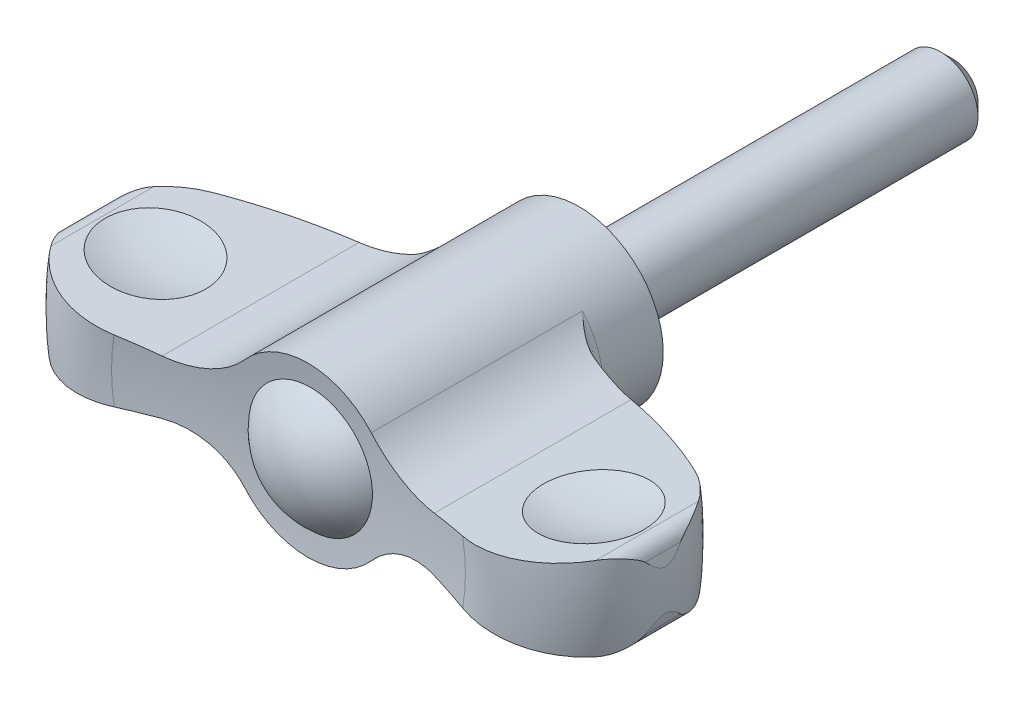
ISO-10303-21;
HEADER;
FILE_DESCRIPTION(('STEP AP214'),'2;1');
FILE_NAME('part.step','',(''),(''),'','','');
FILE_SCHEMA(('AUTOMOTIVE_DESIGN { 1 0 10303 214 1 1 1 1 }'));
ENDSEC;
DATA;
#1=APPLICATION_CONTEXT('core data for automotive mechanical design processes');
#2=APPLICATION_PROTOCOL_DEFINITION('international standard','automotive_design',2000,#1);
#3=PRODUCT_CONTEXT('',#1,'mechanical');
#4=PRODUCT('Part','Part','',(#3));
#5=PRODUCT_RELATED_PRODUCT_CATEGORY('part','',(#4));
#6=PRODUCT_DEFINITION_FORMATION('','',#4);
#7=PRODUCT_DEFINITION_CONTEXT('part definition',#1,'design');
#8=PRODUCT_DEFINITION('design','',#6,#7);
#9=PRODUCT_DEFINITION_SHAPE('','',#8);
#10=(LENGTH_UNIT() NAMED_UNIT(*) SI_UNIT(.MILLI.,.METRE.));
#11=(NAMED_UNIT(*) PLANE_ANGLE_UNIT() SI_UNIT($,.RADIAN.));
#12=(NAMED_UNIT(*) SI_UNIT($,.STERADIAN.) SOLID_ANGLE_UNIT());
#13=UNCERTAINTY_MEASURE_WITH_UNIT(LENGTH_MEASURE(1.E-05),#10,'distance_accuracy_value','');
#14=(GEOMETRIC_REPRESENTATION_CONTEXT(3) GLOBAL_UNCERTAINTY_ASSIGNED_CONTEXT((#13)) GLOBAL_UNIT_ASSIGNED_CONTEXT((#10,
#11,#12)) REPRESENTATION_CONTEXT('',''));
#15=CARTESIAN_POINT('',(0.,0.,0.));
#16=DIRECTION('',(0.,0.,1.));
#17=DIRECTION('',(1.,0.,0.));
#18=AXIS2_PLACEMENT_3D('',#15,#16,#17);
#19=CARTESIAN_POINT('',(0.,0.,72.3));
#20=DIRECTION('',(0.,0.,-1.));
#21=DIRECTION('',(1.,0.,0.));
#22=AXIS2_PLACEMENT_3D('',#19,#20,#21);
#23=SPHERICAL_SURFACE('',#22,51.);
#24=CARTESIAN_POINT('',(0.106101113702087,-0.984705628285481,72.3));
#25=DIRECTION('',(-0.107128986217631,0.994245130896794,0.));
#26=DIRECTION('',(-0.994245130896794,-0.107128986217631,0.));
#27=AXIS2_PLACEMENT_3D('',#24,#25,#26);
#28=CIRCLE('',#27,50.9903824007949);
#29=CARTESIAN_POINT('',(-13.9736878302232,-2.50178976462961,23.3155422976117));
#30=VERTEX_POINT('',#29);
#31=CARTESIAN_POINT('',(-10.91666942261,-2.17239888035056,22.529456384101));
#32=VERTEX_POINT('',#31);
#33=EDGE_CURVE('E30',#30,#32,#28,.F.);
#34=ORIENTED_EDGE('',*,*,#33,.T.);
#35=CARTESIAN_POINT('',(-10.91686942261,-2.17242043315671,22.5295011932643));
#36=CARTESIAN_POINT('',(-10.7296469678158,-2.15222267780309,22.4875506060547));
#37=CARTESIAN_POINT('',(-10.5413017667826,-2.13980901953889,22.4468208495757));
#38=CARTESIAN_POINT('',(-10.1636425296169,-2.13069190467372,22.3680695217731));
#39=CARTESIAN_POINT('',(-9.97432836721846,-2.13399055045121,22.3300483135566));
#40=CARTESIAN_POINT('',(-9.59601268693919,-2.15644826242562,22.2569830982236));
#41=CARTESIAN_POINT('',(-9.40701125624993,-2.17561118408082,22.2219398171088));
#42=CARTESIAN_POINT('',(-9.03072706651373,-2.22980411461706,22.1550981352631));
#43=CARTESIAN_POINT('',(-8.84344419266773,-2.26483305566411,22.1232995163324));
#44=CARTESIAN_POINT('',(-8.47162022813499,-2.35072423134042,22.063129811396));
#45=CARTESIAN_POINT('',(-8.2870846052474,-2.40161451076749,22.034764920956));
#46=CARTESIAN_POINT('',(-7.92248584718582,-2.51896555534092,21.9817487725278));
#47=CARTESIAN_POINT('',(-7.7424225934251,-2.5854259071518,21.9570974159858));
#48=CARTESIAN_POINT('',(-7.38832723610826,-2.7334638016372,21.9117265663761));
#49=CARTESIAN_POINT('',(-7.21428915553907,-2.81502582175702,21.8910030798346));
#50=CARTESIAN_POINT('',(-6.87341920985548,-2.99279306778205,21.8536266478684));
#51=CARTESIAN_POINT('',(-6.70658636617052,-3.08899629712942,21.836973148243));
#52=CARTESIAN_POINT('',(-6.40782206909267,-3.27863643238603,21.8102333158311));
#53=CARTESIAN_POINT('',(-6.27461901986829,-3.36999069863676,21.7995199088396));
#54=CARTESIAN_POINT('',(-6.01493123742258,-3.56204909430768,21.7811068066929));
#55=CARTESIAN_POINT('',(-5.88844563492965,-3.66275200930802,21.7734067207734));
#56=CARTESIAN_POINT('',(-5.64271699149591,-3.87314316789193,21.7610572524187));
#57=CARTESIAN_POINT('',(-5.52348434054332,-3.98284379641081,21.7564121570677));
#58=CARTESIAN_POINT('',(-5.29308424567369,-4.2105332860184,21.7502131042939));
#59=CARTESIAN_POINT('',(-5.18191832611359,-4.32852370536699,21.7486597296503));
#60=CARTESIAN_POINT('',(-5.07512339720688,-4.4503508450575,21.7486647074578));
#61=B_SPLINE_CURVE_WITH_KNOTS('',3,(#35,#36,#37,#38,#39,#40,#41,#42,#43,#44,#45,#46,#47,#48,#49,
#50,#51,#52,#53,#54,#55,#56,#57,#58,#59,#60),.UNSPECIFIED.,.F.,.F.,(4,2,2,2,2,2,2,2,2,2,2,2,4),
(0.,0.578626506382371,1.15733043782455,1.73617505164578,2.31498071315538,2.89481563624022,
3.47463516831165,4.05386199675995,4.63300990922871,5.1182130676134,5.60335328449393,
6.08917285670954,6.57508399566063),.UNSPECIFIED.);
#62=CARTESIAN_POINT('',(-5.07529875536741,-4.4501508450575,21.7486647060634));
#63=VERTEX_POINT('',#62);
#64=EDGE_CURVE('E34',#32,#63,#61,.T.);
#65=ORIENTED_EDGE('',*,*,#64,.T.);
#66=CARTESIAN_POINT('',(0.,0.,21.7486647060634));
#67=DIRECTION('',(0.,0.,1.));
#68=DIRECTION('',(1.,0.,0.));
#69=AXIS2_PLACEMENT_3D('',#66,#67,#68);
#70=CIRCLE('',#69,6.75);
#71=CARTESIAN_POINT('',(5.07529875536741,-4.4501508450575,21.7486647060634));
#72=VERTEX_POINT('',#71);
#73=EDGE_CURVE('E350',#63,#72,#70,.T.);
#74=ORIENTED_EDGE('',*,*,#73,.T.);
#75=CARTESIAN_POINT('',(5.07512339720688,-4.4503508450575,21.7486647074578));
#76=CARTESIAN_POINT('',(5.19811151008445,-4.31003841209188,21.7486568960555));
#77=CARTESIAN_POINT('',(5.32690563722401,-4.1748233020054,21.750718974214));
#78=CARTESIAN_POINT('',(5.59507822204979,-3.91549700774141,21.7589403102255));
#79=CARTESIAN_POINT('',(5.73445549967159,-3.79138458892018,21.7650991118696));
#80=CARTESIAN_POINT('',(6.0224023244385,-3.55546265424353,21.7814490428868));
#81=CARTESIAN_POINT('',(6.17094583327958,-3.44362058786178,21.7916291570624));
#82=CARTESIAN_POINT('',(6.47646460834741,-3.23260452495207,21.8159402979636));
#83=CARTESIAN_POINT('',(6.63343982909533,-3.13343046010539,21.8300713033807));
#84=CARTESIAN_POINT('',(6.9547027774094,-2.94837494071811,21.8621786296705));
#85=CARTESIAN_POINT('',(7.11899194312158,-2.86249611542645,21.8801557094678));
#86=CARTESIAN_POINT('',(7.45373433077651,-2.70454154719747,21.9198257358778));
#87=CARTESIAN_POINT('',(7.62419031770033,-2.63247208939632,21.9415203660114));
#88=CARTESIAN_POINT('',(7.9700647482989,-2.50255377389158,21.9884706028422));
#89=CARTESIAN_POINT('',(8.14548582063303,-2.44471261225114,22.013728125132));
#90=CARTESIAN_POINT('',(8.49988931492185,-2.34360925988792,22.0675996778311));
#91=CARTESIAN_POINT('',(8.67887012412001,-2.30034061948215,22.0962122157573));
#92=CARTESIAN_POINT('',(9.02900148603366,-2.2305564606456,22.1548846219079));
#93=CARTESIAN_POINT('',(9.20002034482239,-2.20322989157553,22.1847703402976));
#94=CARTESIAN_POINT('',(9.54316942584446,-2.1617212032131,22.2471706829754));
#95=CARTESIAN_POINT('',(9.7152996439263,-2.14753903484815,22.2796852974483));
#96=CARTESIAN_POINT('',(10.0596012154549,-2.13229985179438,22.3471369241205));
#97=CARTESIAN_POINT('',(10.2317725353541,-2.13123840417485,22.382073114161));
#98=CARTESIAN_POINT('',(10.5752280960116,-2.14211213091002,22.4541699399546));
#99=CARTESIAN_POINT('',(10.746512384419,-2.154046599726,22.4913304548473));
#100=CARTESIAN_POINT('',(10.91686942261,-2.17242043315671,22.5295011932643));
#101=B_SPLINE_CURVE_WITH_KNOTS('',3,(#75,#76,#77,#78,#79,#80,#81,#82,#83,#84,#85,#86,#87,#88,
#89,#90,#91,#92,#93,#94,#95,#96,#97,#98,#99,#100),.UNSPECIFIED.,.F.,.F.,(4,2,2,2,2,2,2,2,2,2,2,
2,4),(0.,0.559574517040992,1.11908673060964,1.67707683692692,2.2350639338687,2.79316123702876,
3.35151194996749,3.91016401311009,4.46856849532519,4.99529953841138,5.52202861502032,
6.04857972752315,6.57510225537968),.UNSPECIFIED.);
#102=CARTESIAN_POINT('',(10.91666942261,-2.17239888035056,22.529456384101));
#103=VERTEX_POINT('',#102);
#104=EDGE_CURVE('E343',#72,#103,#101,.T.);
#105=ORIENTED_EDGE('',*,*,#104,.T.);
#106=CARTESIAN_POINT('',(-0.10610111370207,-0.984705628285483,72.3));
#107=DIRECTION('',(0.107128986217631,0.994245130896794,0.));
#108=DIRECTION('',(-0.994245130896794,0.107128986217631,0.));
#109=AXIS2_PLACEMENT_3D('',#106,#107,#108);
#110=CIRCLE('',#109,50.9903824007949);
#111=CARTESIAN_POINT('',(13.9736878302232,-2.50178976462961,23.3155422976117));
#112=VERTEX_POINT('',#111);
#113=EDGE_CURVE('E351',#103,#112,#110,.F.);
#114=ORIENTED_EDGE('',*,*,#113,.T.);
#115=CARTESIAN_POINT('',(0.,0.,23.3155422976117));
#116=DIRECTION('',(0.,0.,-1.));
#117=DIRECTION('',(-1.,0.,0.));
#118=AXIS2_PLACEMENT_3D('',#115,#116,#117);
#119=CIRCLE('',#118,14.1958762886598);
#120=CARTESIAN_POINT('',(13.9736878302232,2.50178976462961,23.3155422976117));
#121=VERTEX_POINT('',#120);
#122=EDGE_CURVE('E186',#121,#112,#119,.T.);
#123=ORIENTED_EDGE('',*,*,#122,.F.);
#124=CARTESIAN_POINT('',(-0.10610111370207,0.984705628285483,72.3));
#125=DIRECTION('',(0.107128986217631,-0.994245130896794,0.));
#126=DIRECTION('',(0.994245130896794,0.107128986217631,0.));
#127=AXIS2_PLACEMENT_3D('',#124,#125,#126);
#128=CIRCLE('',#127,50.9903824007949);
#129=CARTESIAN_POINT('',(10.91666942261,2.17239888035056,22.529456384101));
#130=VERTEX_POINT('',#129);
#131=EDGE_CURVE('E370',#121,#130,#128,.F.);
#132=ORIENTED_EDGE('',*,*,#131,.T.);
#133=CARTESIAN_POINT('',(10.91686942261,2.17242043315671,22.5295011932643));
#134=CARTESIAN_POINT('',(10.7296469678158,2.15222267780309,22.4875506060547));
#135=CARTESIAN_POINT('',(10.5413017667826,2.13980901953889,22.4468208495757));
#136=CARTESIAN_POINT('',(10.1636425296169,2.13069190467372,22.3680695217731));
#137=CARTESIAN_POINT('',(9.97432836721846,2.13399055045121,22.3300483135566));
#138=CARTESIAN_POINT('',(9.59601268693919,2.15644826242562,22.2569830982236));
#139=CARTESIAN_POINT('',(9.40701125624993,2.17561118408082,22.2219398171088));
#140=CARTESIAN_POINT('',(9.03072706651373,2.22980411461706,22.1550981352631));
#141=CARTESIAN_POINT('',(8.84344419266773,2.26483305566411,22.1232995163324));
#142=CARTESIAN_POINT('',(8.47162022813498,2.35072423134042,22.063129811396));
#143=CARTESIAN_POINT('',(8.2870846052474,2.40161451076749,22.034764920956));
#144=CARTESIAN_POINT('',(7.92248584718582,2.51896555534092,21.9817487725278));
#145=CARTESIAN_POINT('',(7.7424225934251,2.5854259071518,21.9570974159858));
#146=CARTESIAN_POINT('',(7.38832723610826,2.7334638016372,21.9117265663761));
#147=CARTESIAN_POINT('',(7.21428915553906,2.81502582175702,21.8910030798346));
#148=CARTESIAN_POINT('',(6.87341920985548,2.99279306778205,21.8536266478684));
#149=CARTESIAN_POINT('',(6.70658636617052,3.08899629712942,21.836973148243));
#150=CARTESIAN_POINT('',(6.40782206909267,3.27863643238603,21.8102333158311));
#151=CARTESIAN_POINT('',(6.27461901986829,3.36999069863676,21.7995199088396));
#152=CARTESIAN_POINT('',(6.01493123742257,3.56204909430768,21.7811068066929));
#153=CARTESIAN_POINT('',(5.88844563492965,3.66275200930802,21.7734067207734));
#154=CARTESIAN_POINT('',(5.64271699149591,3.87314316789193,21.7610572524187));
#155=CARTESIAN_POINT('',(5.52348434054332,3.98284379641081,21.7564121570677));
#156=CARTESIAN_POINT('',(5.29308424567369,4.2105332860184,21.7502131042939));
#157=CARTESIAN_POINT('',(5.18191832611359,4.32852370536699,21.7486597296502));
#158=CARTESIAN_POINT('',(5.07512339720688,4.4503508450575,21.7486647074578));
#159=B_SPLINE_CURVE_WITH_KNOTS('',3,(#133,#134,#135,#136,#137,#138,#139,#140,#141,#142,#143,
#144,#145,#146,#147,#148,#149,#150,#151,#152,#153,#154,#155,#156,#157,#158),.UNSPECIFIED.,.F.,
.F.,(4,2,2,2,2,2,2,2,2,2,2,2,4),(0.,0.578626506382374,1.15733043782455,1.73617505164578,
2.31498071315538,2.89481563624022,3.47463516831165,4.05386199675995,4.63300990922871,
5.1182130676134,5.60335328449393,6.08917285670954,6.57508399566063),.UNSPECIFIED.);
#160=CARTESIAN_POINT('',(5.07529875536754,4.45015084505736,21.7486647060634));
#161=VERTEX_POINT('',#160);
#162=EDGE_CURVE('E320',#130,#161,#159,.T.);
#163=ORIENTED_EDGE('',*,*,#162,.T.);
#164=CARTESIAN_POINT('',(0.,0.,21.7486647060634));
#165=DIRECTION('',(0.,0.,1.));
#166=DIRECTION('',(1.,0.,0.));
#167=AXIS2_PLACEMENT_3D('',#164,#165,#166);
#168=CIRCLE('',#167,6.75);
#169=CARTESIAN_POINT('',(-5.07529875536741,4.4501508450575,21.7486647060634));
#170=VERTEX_POINT('',#169);
#171=EDGE_CURVE('E326',#161,#170,#168,.T.);
#172=ORIENTED_EDGE('',*,*,#171,.T.);
#173=CARTESIAN_POINT('',(-5.07512339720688,4.4503508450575,21.7486647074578));
#174=CARTESIAN_POINT('',(-5.19811151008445,4.31003841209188,21.7486568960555));
#175=CARTESIAN_POINT('',(-5.32690563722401,4.1748233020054,21.750718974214));
#176=CARTESIAN_POINT('',(-5.59507822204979,3.91549700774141,21.7589403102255));
#177=CARTESIAN_POINT('',(-5.73445549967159,3.79138458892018,21.7650991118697));
#178=CARTESIAN_POINT('',(-6.0224023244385,3.55546265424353,21.7814490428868));
#179=CARTESIAN_POINT('',(-6.17094583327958,3.44362058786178,21.7916291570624));
#180=CARTESIAN_POINT('',(-6.47646460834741,3.23260452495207,21.8159402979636));
#181=CARTESIAN_POINT('',(-6.63343982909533,3.13343046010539,21.8300713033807));
#182=CARTESIAN_POINT('',(-6.9547027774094,2.94837494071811,21.8621786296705));
#183=CARTESIAN_POINT('',(-7.11899194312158,2.86249611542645,21.8801557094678));
#184=CARTESIAN_POINT('',(-7.45373433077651,2.70454154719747,21.9198257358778));
#185=CARTESIAN_POINT('',(-7.62419031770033,2.63247208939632,21.9415203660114));
#186=CARTESIAN_POINT('',(-7.9700647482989,2.50255377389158,21.9884706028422));
#187=CARTESIAN_POINT('',(-8.14548582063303,2.44471261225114,22.013728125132));
#188=CARTESIAN_POINT('',(-8.49988931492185,2.34360925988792,22.0675996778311));
#189=CARTESIAN_POINT('',(-8.67887012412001,2.30034061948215,22.0962122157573));
#190=CARTESIAN_POINT('',(-9.02900148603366,2.2305564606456,22.1548846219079));
#191=CARTESIAN_POINT('',(-9.20002034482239,2.20322989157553,22.1847703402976));
#192=CARTESIAN_POINT('',(-9.54316942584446,2.1617212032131,22.2471706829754));
#193=CARTESIAN_POINT('',(-9.7152996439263,2.14753903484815,22.2796852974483));
#194=CARTESIAN_POINT('',(-10.0596012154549,2.13229985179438,22.3471369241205));
#195=CARTESIAN_POINT('',(-10.2317725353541,2.13123840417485,22.382073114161));
#196=CARTESIAN_POINT('',(-10.5752280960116,2.14211213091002,22.4541699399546));
#197=CARTESIAN_POINT('',(-10.746512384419,2.154046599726,22.4913304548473));
#198=CARTESIAN_POINT('',(-10.91686942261,2.17242043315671,22.5295011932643));
#199=B_SPLINE_CURVE_WITH_KNOTS('',3,(#173,#174,#175,#176,#177,#178,#179,#180,#181,#182,#183,
#184,#185,#186,#187,#188,#189,#190,#191,#192,#193,#194,#195,#196,#197,#198),.UNSPECIFIED.,.F.,
.F.,(4,2,2,2,2,2,2,2,2,2,2,2,4),(0.,0.559574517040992,1.11908673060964,1.67707683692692,
2.2350639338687,2.79316123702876,3.35151194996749,3.91016401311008,4.46856849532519,
4.99529953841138,5.52202861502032,6.04857972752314,6.57510225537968),.UNSPECIFIED.);
#200=CARTESIAN_POINT('',(-10.91666942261,2.17239888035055,22.529456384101));
#201=VERTEX_POINT('',#200);
#202=EDGE_CURVE('E191',#170,#201,#199,.T.);
#203=ORIENTED_EDGE('',*,*,#202,.T.);
#204=CARTESIAN_POINT('',(0.106101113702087,0.984705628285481,72.3));
#205=DIRECTION('',(-0.107128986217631,-0.994245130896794,0.));
#206=DIRECTION('',(0.994245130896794,-0.107128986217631,0.));
#207=AXIS2_PLACEMENT_3D('',#204,#205,#206);
#208=CIRCLE('',#207,50.9903824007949);
#209=CARTESIAN_POINT('',(-13.9736878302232,2.50178976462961,23.3155422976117));
#210=VERTEX_POINT('',#209);
#211=EDGE_CURVE('E446',#201,#210,#208,.F.);
#212=ORIENTED_EDGE('',*,*,#211,.T.);
#213=EDGE_CURVE('E495',#30,#210,#119,.T.);
#214=ORIENTED_EDGE('',*,*,#213,.F.);
#215=EDGE_LOOP('',(#34,#65,#74,#105,#114,#123,#132,#163,#172,#203,#212,#214));
#216=FACE_BOUND('',#215,.T.);
#217=CARTESIAN_POINT('',(0.,0.,21.5419708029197));
#218=DIRECTION('',(0.,0.,-1.));
#219=DIRECTION('',(-1.,0.,0.));
#220=AXIS2_PLACEMENT_3D('',#217,#218,#219);
#221=CIRCLE('',#220,4.96210358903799);
#222=CARTESIAN_POINT('',(-4.96210358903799,0.,21.5419708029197));
#223=VERTEX_POINT('',#222);
#224=EDGE_CURVE('E383',#223,#223,#221,.T.);
#225=ORIENTED_EDGE('',*,*,#224,.T.);
#226=EDGE_LOOP('',(#225));
#227=FACE_BOUND('',#226,.T.);
#228=ADVANCED_FACE('F14',(#216,#227),#23,.F.);
#229=CARTESIAN_POINT('',(-10.91666942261,-2.17239888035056,24.));
#230=DIRECTION('',(-0.107128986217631,0.994245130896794,0.));
#231=DIRECTION('',(-0.994245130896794,-0.107128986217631,0.));
#232=AXIS2_PLACEMENT_3D('',#229,#230,#231);
#233=PLANE('',#232);
#234=ORIENTED_EDGE('',*,*,#33,.F.);
#235=CARTESIAN_POINT('',(-21.8457309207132,-3.34999507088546,20.5252646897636));
#236=CARTESIAN_POINT('',(-21.7302435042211,-3.33755140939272,20.6912978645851));
#237=CARTESIAN_POINT('',(-21.6077536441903,-3.32435324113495,20.8523984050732));
#238=CARTESIAN_POINT('',(-21.3497248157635,-3.29655087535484,21.1636425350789));
#239=CARTESIAN_POINT('',(-21.2141865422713,-3.28194675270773,21.3137867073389));
#240=CARTESIAN_POINT('',(-20.9311105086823,-3.25144557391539,21.6019360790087));
#241=CARTESIAN_POINT('',(-20.783581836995,-3.23554949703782,21.7399503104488));
#242=CARTESIAN_POINT('',(-20.4774952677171,-3.20256895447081,22.0029918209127));
#243=CARTESIAN_POINT('',(-20.3189374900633,-3.18548450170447,22.1280192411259));
#244=CARTESIAN_POINT('',(-19.9918782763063,-3.15024417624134,22.3642331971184));
#245=CARTESIAN_POINT('',(-19.8233743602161,-3.13208803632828,22.4754162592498));
#246=CARTESIAN_POINT('',(-19.4775952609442,-3.09483066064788,22.6831586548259));
#247=CARTESIAN_POINT('',(-19.3003168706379,-3.07572907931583,22.7797125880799));
#248=CARTESIAN_POINT('',(-18.9383738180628,-3.0367300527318,22.9574348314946));
#249=CARTESIAN_POINT('',(-18.7537118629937,-3.01683289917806,23.0386087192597));
#250=CARTESIAN_POINT('',(-18.3782492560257,-2.97637715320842,23.1850463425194));
#251=CARTESIAN_POINT('',(-18.1874484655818,-2.95581854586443,23.2503097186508));
#252=CARTESIAN_POINT('',(-17.8008818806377,-2.91416635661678,23.3645224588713));
#253=CARTESIAN_POINT('',(-17.6051115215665,-2.89307228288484,23.4134561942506));
#254=CARTESIAN_POINT('',(-17.2101714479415,-2.85051785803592,23.4945837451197));
#255=CARTESIAN_POINT('',(-17.011001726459,-2.82905750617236,23.5267775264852));
#256=CARTESIAN_POINT('',(-16.6106619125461,-2.78592126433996,23.5742057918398));
#257=CARTESIAN_POINT('',(-16.4094916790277,-2.76424535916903,23.589439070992));
#258=CARTESIAN_POINT('',(-16.006594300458,-2.72083354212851,23.6028415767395));
#259=CARTESIAN_POINT('',(-15.804867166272,-2.69909763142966,23.6010111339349));
#260=CARTESIAN_POINT('',(-15.4019677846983,-2.65568559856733,23.5802910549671));
#261=CARTESIAN_POINT('',(-15.2007968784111,-2.63400962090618,23.5613750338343));
#262=CARTESIAN_POINT('',(-14.8008192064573,-2.59091239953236,23.5065973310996));
#263=CARTESIAN_POINT('',(-14.6020116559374,-2.56949107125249,23.47074144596));
#264=CARTESIAN_POINT('',(-14.2079744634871,-2.52703393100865,23.3823184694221));
#265=CARTESIAN_POINT('',(-14.0127471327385,-2.50599836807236,23.3297409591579));
#266=CARTESIAN_POINT('',(-13.6273876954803,-2.46447624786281,23.208260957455));
#267=CARTESIAN_POINT('',(-13.4372553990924,-2.44398967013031,23.1393590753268));
#268=CARTESIAN_POINT('',(-13.0629639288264,-2.40366011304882,22.985531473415));
#269=CARTESIAN_POINT('',(-12.8788206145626,-2.38381884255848,22.9005667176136));
#270=CARTESIAN_POINT('',(-12.5183119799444,-2.34497437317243,22.7153302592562));
#271=CARTESIAN_POINT('',(-12.3419464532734,-2.3259711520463,22.6150589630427));
#272=CARTESIAN_POINT('',(-11.9985630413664,-2.28897190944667,22.400122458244));
#273=CARTESIAN_POINT('',(-11.8315288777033,-2.27097413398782,22.2854835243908));
#274=CARTESIAN_POINT('',(-11.5077189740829,-2.23608391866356,22.0425218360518));
#275=CARTESIAN_POINT('',(-11.3509370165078,-2.21919080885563,21.9142075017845));
#276=CARTESIAN_POINT('',(-11.1514082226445,-2.19769176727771,21.7363546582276));
#277=CARTESIAN_POINT('',(-11.1035524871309,-2.19253535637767,21.6925222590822));
#278=CARTESIAN_POINT('',(-11.0090859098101,-2.18235667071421,21.6036210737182));
#279=CARTESIAN_POINT('',(-10.9624737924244,-2.17733425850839,21.5585536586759));
#280=CARTESIAN_POINT('',(-10.91646942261,-2.17237733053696,21.5128574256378));
#281=B_SPLINE_CURVE_WITH_KNOTS('',3,(#235,#236,#237,#238,#239,#240,#241,#242,#243,#244,#245,
#246,#247,#248,#249,#250,#251,#252,#253,#254,#255,#256,#257,#258,#259,#260,#261,#262,#263,#264,
#265,#266,#267,#268,#269,#270,#271,#272,#273,#274,#275,#276,#277,#278,#279,#280),.UNSPECIFIED.,
.F.,.F.,(4,2,2,2,2,2,2,2,2,2,2,2,2,2,2,2,2,2,2,2,2,2,4),(0.,0.607705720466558,1.21537909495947,
1.82259608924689,2.42980648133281,3.03716892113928,3.64475501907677,4.25212035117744,
4.85949940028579,5.46745810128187,6.07541804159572,6.68342116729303,7.29141251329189,
7.90034437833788,8.50906803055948,9.11817171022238,9.72725265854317,10.3378332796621,
10.9483976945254,11.557861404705,12.166952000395,12.3622359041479,12.5573111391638),.UNSPECIFIED.);
#282=CARTESIAN_POINT('',(-21.8455309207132,-3.34997352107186,20.5255521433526));
#283=VERTEX_POINT('',#282);
#284=EDGE_CURVE('E904',#283,#30,#281,.T.);
#285=ORIENTED_EDGE('',*,*,#284,.F.);
#286=DIRECTION('',(0.,0.,-1.));
#287=VECTOR('',#286,1.);
#288=CARTESIAN_POINT('',(-21.8455309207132,-3.34997352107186,24.));
#289=LINE('',#288,#287);
#290=CARTESIAN_POINT('',(-21.8455309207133,-3.34997352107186,12.2746267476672));
#291=VERTEX_POINT('',#290);
#292=EDGE_CURVE('E465',#283,#291,#289,.T.);
#293=ORIENTED_EDGE('',*,*,#292,.T.);
#294=CARTESIAN_POINT('',(-19.2945778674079,-3.07511070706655,10.0206583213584));
#295=CARTESIAN_POINT('',(-19.4747975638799,-3.09452921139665,10.1153575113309));
#296=CARTESIAN_POINT('',(-19.6509896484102,-3.11351374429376,10.2178086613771));
#297=CARTESIAN_POINT('',(-19.9941575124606,-3.15048976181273,10.4374340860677));
#298=CARTESIAN_POINT('',(-20.1611295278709,-3.16848084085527,10.55461431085));
#299=CARTESIAN_POINT('',(-20.4813600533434,-3.20298538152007,10.8003921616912));
#300=CARTESIAN_POINT('',(-20.6348240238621,-3.21952098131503,10.9287191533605));
#301=CARTESIAN_POINT('',(-20.9305024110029,-3.25138005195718,11.1977390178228));
#302=CARTESIAN_POINT('',(-21.0727226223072,-3.26670414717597,11.3384254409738));
#303=CARTESIAN_POINT('',(-21.3235946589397,-3.29373537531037,11.608219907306));
#304=CARTESIAN_POINT('',(-21.43401009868,-3.3056325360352,11.7356749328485));
#305=CARTESIAN_POINT('',(-21.6465578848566,-3.32853436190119,11.9991858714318));
#306=CARTESIAN_POINT('',(-21.7486121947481,-3.33953061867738,12.135305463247));
#307=CARTESIAN_POINT('',(-21.8457309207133,-3.34999507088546,12.2749142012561));
#308=B_SPLINE_CURVE_WITH_KNOTS('',3,(#294,#295,#296,#297,#298,#299,#300,#301,#302,#303,#304,
#305,#306,#307),.UNSPECIFIED.,.F.,.F.,(4,2,2,2,2,2,4),(0.,0.613344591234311,1.22693775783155,
1.82843414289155,2.42961848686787,2.93636077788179,3.44739305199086),.UNSPECIFIED.);
#309=CARTESIAN_POINT('',(-19.2949583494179,-3.07515170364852,10.0208583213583));
#310=VERTEX_POINT('',#309);
#311=EDGE_CURVE('E877',#310,#291,#308,.T.);
#312=ORIENTED_EDGE('',*,*,#311,.F.);
#313=CARTESIAN_POINT('',(-10.91646942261,-2.17237733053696,6.74022888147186));
#314=CARTESIAN_POINT('',(-11.6429801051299,-2.2506581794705,6.93529272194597));
#315=CARTESIAN_POINT('',(-12.3641189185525,-2.32836021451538,7.15058575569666));
#316=CARTESIAN_POINT('',(-13.791310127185,-2.48213873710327,7.62017172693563));
#317=CARTESIAN_POINT('',(-14.4974016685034,-2.558219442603,7.87434431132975));
#318=CARTESIAN_POINT('',(-15.8945921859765,-2.70876541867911,8.42142446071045));
#319=CARTESIAN_POINT('',(-16.5856911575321,-2.78323068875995,8.71433203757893));
#320=CARTESIAN_POINT('',(-17.9528888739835,-2.93054496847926,9.33891493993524));
#321=CARTESIAN_POINT('',(-18.6289355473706,-3.0033883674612,9.67070557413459));
#322=CARTESIAN_POINT('',(-19.2953387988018,-3.07519269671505,10.0210583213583));
#323=B_SPLINE_CURVE_WITH_KNOTS('',3,(#313,#314,#315,#316,#317,#318,#319,#320,#321,#322),
.UNSPECIFIED.,.F.,.F.,(4,2,2,2,4),(0.,2.26861905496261,4.53035255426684,6.79208674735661,
9.06070650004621),.UNSPECIFIED.);
#324=CARTESIAN_POINT('',(-10.91666942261,-2.17239888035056,6.74028258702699));
#325=VERTEX_POINT('',#324);
#326=EDGE_CURVE('E268',#325,#310,#323,.T.);
#327=ORIENTED_EDGE('',*,*,#326,.F.);
#328=DIRECTION('',(0.,0.,-1.));
#329=VECTOR('',#328,1.);
#330=CARTESIAN_POINT('',(-10.91666942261,-2.17239888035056,24.));
#331=LINE('',#330,#329);
#332=EDGE_CURVE('E462',#32,#325,#331,.T.);
#333=ORIENTED_EDGE('',*,*,#332,.F.);
#334=EDGE_LOOP('',(#234,#285,#293,#312,#327,#333));
#335=FACE_BOUND('',#334,.T.);
#336=CARTESIAN_POINT('',(-17.5815922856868,-2.89053810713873,16.4));
#337=DIRECTION('',(-0.107128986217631,0.994245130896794,0.));
#338=DIRECTION('',(-0.994245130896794,-0.107128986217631,0.));
#339=AXIS2_PLACEMENT_3D('',#336,#337,#338);
#340=CIRCLE('',#339,4.06502356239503);
#341=CARTESIAN_POINT('',(-21.6232221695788,-3.3260199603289,16.4));
#342=VERTEX_POINT('',#341);
#343=EDGE_CURVE('E380',#342,#342,#340,.F.);
#344=ORIENTED_EDGE('',*,*,#343,.F.);
#345=EDGE_LOOP('',(#344));
#346=FACE_BOUND('',#345,.T.);
#347=ADVANCED_FACE('F292',(#335,#346),#233,.F.);
#348=CARTESIAN_POINT('',(-10.91666942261,2.17239888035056,24.));
#349=DIRECTION('',(-0.107128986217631,-0.994245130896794,0.));
#350=DIRECTION('',(0.994245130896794,-0.107128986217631,0.));
#351=AXIS2_PLACEMENT_3D('',#348,#349,#350);
#352=PLANE('',#351);
#353=ORIENTED_EDGE('',*,*,#211,.F.);
#354=DIRECTION('',(0.,0.,-1.));
#355=VECTOR('',#354,1.);
#356=CARTESIAN_POINT('',(-10.91666942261,2.17239888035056,24.));
#357=LINE('',#356,#355);
#358=CARTESIAN_POINT('',(-10.91666942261,2.17239888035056,6.74028258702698));
#359=VERTEX_POINT('',#358);
#360=EDGE_CURVE('E193',#201,#359,#357,.T.);
#361=ORIENTED_EDGE('',*,*,#360,.T.);
#362=CARTESIAN_POINT('',(-19.2953387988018,3.07519269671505,10.0210583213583));
#363=CARTESIAN_POINT('',(-18.6289355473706,3.0033883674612,9.67070557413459));
#364=CARTESIAN_POINT('',(-17.9528888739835,2.93054496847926,9.33891493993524));
#365=CARTESIAN_POINT('',(-16.5856911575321,2.78323068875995,8.71433203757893));
#366=CARTESIAN_POINT('',(-15.8945921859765,2.70876541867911,8.42142446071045));
#367=CARTESIAN_POINT('',(-14.4974016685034,2.558219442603,7.87434431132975));
#368=CARTESIAN_POINT('',(-13.791310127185,2.48213873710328,7.62017172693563));
#369=CARTESIAN_POINT('',(-12.3641189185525,2.32836021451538,7.15058575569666));
#370=CARTESIAN_POINT('',(-11.6429801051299,2.2506581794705,6.93529272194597));
#371=CARTESIAN_POINT('',(-10.91646942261,2.17237733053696,6.74022888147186));
#372=B_SPLINE_CURVE_WITH_KNOTS('',3,(#362,#363,#364,#365,#366,#367,#368,#369,#370,#371),
.UNSPECIFIED.,.F.,.F.,(4,2,2,2,4),(0.,2.2686197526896,4.53035394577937,6.7920874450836,
9.06070650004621),.UNSPECIFIED.);
#373=CARTESIAN_POINT('',(-19.2949583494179,3.07515170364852,10.0208583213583));
#374=VERTEX_POINT('',#373);
#375=EDGE_CURVE('E275',#374,#359,#372,.T.);
#376=ORIENTED_EDGE('',*,*,#375,.F.);
#377=CARTESIAN_POINT('',(-16.1316021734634,2.73430302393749,9.20190527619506));
#378=CARTESIAN_POINT('',(-16.3336188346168,2.75607013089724,9.20643915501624));
#379=CARTESIAN_POINT('',(-16.5354410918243,2.777816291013,9.2195877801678));
#380=CARTESIAN_POINT('',(-16.9372607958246,2.82111198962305,9.2629315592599));
#381=CARTESIAN_POINT('',(-17.1372583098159,2.84266153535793,9.29312608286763));
#382=CARTESIAN_POINT('',(-17.53371131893,2.88537897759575,9.37032135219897));
#383=CARTESIAN_POINT('',(-17.7301716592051,2.90654739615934,9.41729692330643));
#384=CARTESIAN_POINT('',(-18.1184556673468,2.94838463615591,9.52772695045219));
#385=CARTESIAN_POINT('',(-18.310279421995,2.9690534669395,9.59118109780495));
#386=CARTESIAN_POINT('',(-18.6875910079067,3.00970843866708,9.73399849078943));
#387=CARTESIAN_POINT('',(-18.8730894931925,3.02969572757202,9.81333326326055));
#388=CARTESIAN_POINT('',(-19.236871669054,3.0688929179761,9.98746420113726));
#389=CARTESIAN_POINT('',(-19.4151520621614,3.08810246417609,10.0822673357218));
#390=CARTESIAN_POINT('',(-19.7631321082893,3.12559698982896,10.2866372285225));
#391=CARTESIAN_POINT('',(-19.9328321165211,3.14388200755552,10.3962033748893));
#392=CARTESIAN_POINT('',(-20.2623750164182,3.17938994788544,10.6292750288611));
#393=CARTESIAN_POINT('',(-20.4222223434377,3.19661334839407,10.7527741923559));
#394=CARTESIAN_POINT('',(-20.7309200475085,3.22987523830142,11.0128081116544));
#395=CARTESIAN_POINT('',(-20.8797763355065,3.24591436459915,11.1493357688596));
#396=CARTESIAN_POINT('',(-21.1655301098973,3.27670406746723,11.4345171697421));
#397=CARTESIAN_POINT('',(-21.3024274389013,3.29145462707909,11.58317107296));
#398=CARTESIAN_POINT('',(-21.5634920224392,3.3195840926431,11.8918051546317));
#399=CARTESIAN_POINT('',(-21.6876381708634,3.33296072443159,12.0518033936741));
#400=CARTESIAN_POINT('',(-21.9220837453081,3.35822201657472,12.3817648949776));
#401=CARTESIAN_POINT('',(-22.0323824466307,3.37010659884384,12.5517286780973));
#402=CARTESIAN_POINT('',(-22.1353199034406,3.3811980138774,12.7260937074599));
#403=B_SPLINE_CURVE_WITH_KNOTS('',3,(#377,#378,#379,#380,#381,#382,#383,#384,#385,#386,#387,
#388,#389,#390,#391,#392,#393,#394,#395,#396,#397,#398,#399,#400,#401,#402),.UNSPECIFIED.,.F.,
.F.,(4,2,2,2,2,2,2,2,2,2,2,2,4),(0.,0.60952472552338,1.21902691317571,1.82761855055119,
2.43619878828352,3.04369749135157,3.65147065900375,4.25921864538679,4.86669101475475,
5.47383427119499,6.080985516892,6.68912606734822,7.29729843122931),.UNSPECIFIED.);
#404=CARTESIAN_POINT('',(-21.845530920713,3.34997352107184,12.2746267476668));
#405=VERTEX_POINT('',#404);
#406=EDGE_CURVE('E302',#405,#374,#403,.F.);
#407=ORIENTED_EDGE('',*,*,#406,.F.);
#408=DIRECTION('',(0.,0.,-1.));
#409=VECTOR('',#408,1.);
#410=CARTESIAN_POINT('',(-21.8455309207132,3.34997352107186,24.));
#411=LINE('',#410,#409);
#412=CARTESIAN_POINT('',(-21.8455309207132,3.34997352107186,20.5255521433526));
#413=VERTEX_POINT('',#412);
#414=EDGE_CURVE('E198',#413,#405,#411,.T.);
#415=ORIENTED_EDGE('',*,*,#414,.F.);
#416=CARTESIAN_POINT('',(-10.91646942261,2.17237733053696,21.5128574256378));
#417=CARTESIAN_POINT('',(-11.060414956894,2.18788732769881,21.6558705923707));
#418=CARTESIAN_POINT('',(-11.2103909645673,2.20404710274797,21.7927365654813));
#419=CARTESIAN_POINT('',(-11.5212615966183,2.23754312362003,22.0532734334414));
#420=CARTESIAN_POINT('',(-11.682155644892,2.25487930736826,22.1769450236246));
#421=CARTESIAN_POINT('',(-12.013622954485,2.29059460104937,22.4101285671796));
#422=CARTESIAN_POINT('',(-12.1841895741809,2.3089729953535,22.5196500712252));
#423=CARTESIAN_POINT('',(-12.5338820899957,2.3466520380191,22.723861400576));
#424=CARTESIAN_POINT('',(-12.7130078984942,2.36595267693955,22.8185513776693));
#425=CARTESIAN_POINT('',(-13.0785959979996,2.40534445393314,22.9924500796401));
#426=CARTESIAN_POINT('',(-13.2650601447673,2.42543579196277,23.0716548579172));
#427=CARTESIAN_POINT('',(-13.6440277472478,2.46626919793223,23.2140153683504));
#428=CARTESIAN_POINT('',(-13.8365334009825,2.48701150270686,23.2771651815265));
#429=CARTESIAN_POINT('',(-14.2260776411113,2.5289845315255,23.3869042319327));
#430=CARTESIAN_POINT('',(-14.4231144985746,2.55021506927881,23.433499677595));
#431=CARTESIAN_POINT('',(-14.8203952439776,2.59302169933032,23.5098273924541));
#432=CARTESIAN_POINT('',(-15.0206391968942,2.6145977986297,23.5395593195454));
#433=CARTESIAN_POINT('',(-15.4229162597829,2.65794277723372,23.581941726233));
#434=CARTESIAN_POINT('',(-15.6249494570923,2.67971166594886,23.5945913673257));
#435=CARTESIAN_POINT('',(-16.0293573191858,2.72328623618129,23.6027094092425));
#436=CARTESIAN_POINT('',(-16.2317319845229,2.74509191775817,23.5981777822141));
#437=CARTESIAN_POINT('',(-16.6353922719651,2.78858593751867,23.5719573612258));
#438=CARTESIAN_POINT('',(-16.8366778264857,2.81027426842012,23.5502675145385));
#439=CARTESIAN_POINT('',(-17.2367059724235,2.85337692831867,23.4898773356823));
#440=CARTESIAN_POINT('',(-17.4354486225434,2.87479126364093,23.451177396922));
#441=CARTESIAN_POINT('',(-17.8286809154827,2.91716167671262,23.3571066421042));
#442=CARTESIAN_POINT('',(-18.0231764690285,2.93811839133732,23.3017608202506));
#443=CARTESIAN_POINT('',(-18.4067663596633,2.97944984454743,23.1747874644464));
#444=CARTESIAN_POINT('',(-18.5958625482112,2.99982478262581,23.1031655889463));
#445=CARTESIAN_POINT('',(-18.9674894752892,3.03986723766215,22.9440840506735));
#446=CARTESIAN_POINT('',(-19.1500160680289,3.05953430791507,22.8566145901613));
#447=CARTESIAN_POINT('',(-19.5070671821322,3.09800623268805,22.6664899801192));
#448=CARTESIAN_POINT('',(-19.6815920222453,3.11681112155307,22.5638354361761));
#449=CARTESIAN_POINT('',(-20.0212685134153,3.15341094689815,22.3441502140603));
#450=CARTESIAN_POINT('',(-20.1864271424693,3.17120663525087,22.2271304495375));
#451=CARTESIAN_POINT('',(-20.5063289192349,3.20567575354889,21.9794851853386));
#452=CARTESIAN_POINT('',(-20.6610723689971,3.22234921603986,21.8488600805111));
#453=CARTESIAN_POINT('',(-20.9587578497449,3.25442454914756,21.5751939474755));
#454=CARTESIAN_POINT('',(-21.1017211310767,3.26982870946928,21.4321762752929));
#455=CARTESIAN_POINT('',(-21.3750859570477,3.29928351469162,21.1345878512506));
#456=CARTESIAN_POINT('',(-21.5054952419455,3.31333499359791,20.9800243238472));
#457=CARTESIAN_POINT('',(-21.6665115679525,3.33068435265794,20.7720063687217));
#458=CARTESIAN_POINT('',(-21.7032508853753,3.3346429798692,20.7232730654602));
#459=CARTESIAN_POINT('',(-21.7754460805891,3.34242194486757,20.6249310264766));
#460=CARTESIAN_POINT('',(-21.8109032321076,3.34624241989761,20.5753232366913));
#461=CARTESIAN_POINT('',(-21.8457309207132,3.34999507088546,20.5252646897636));
#462=B_SPLINE_CURVE_WITH_KNOTS('',3,(#416,#417,#418,#419,#420,#421,#422,#423,#424,#425,#426,
#427,#428,#429,#430,#431,#432,#433,#434,#435,#436,#437,#438,#439,#440,#441,#442,#443,#444,#445,
#446,#447,#448,#449,#450,#451,#452,#453,#454,#455,#456,#457,#458,#459,#460,#461),.UNSPECIFIED.,
.F.,.F.,(4,2,2,2,2,2,2,2,2,2,2,2,2,2,2,2,2,2,2,2,2,2,4),(0.,0.610322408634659,1.22061263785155,
1.83048877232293,2.44035866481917,3.05038378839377,3.66063348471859,4.27065407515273,
4.88068704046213,5.49074994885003,6.10081384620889,6.71091517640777,7.32100239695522,
7.93017809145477,8.5391423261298,9.14848434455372,9.75780206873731,10.3666597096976,
10.9754996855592,11.5832161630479,12.1905555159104,12.3740180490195,12.5572930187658),.UNSPECIFIED.);
#463=EDGE_CURVE('E308',#210,#413,#462,.T.);
#464=ORIENTED_EDGE('',*,*,#463,.F.);
#465=EDGE_LOOP('',(#353,#361,#376,#407,#415,#464));
#466=FACE_BOUND('',#465,.T.);
#467=CARTESIAN_POINT('',(-17.5815922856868,2.89053810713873,16.4));
#468=DIRECTION('',(-0.107128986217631,-0.994245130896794,0.));
#469=DIRECTION('',(0.994245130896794,-0.107128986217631,0.));
#470=AXIS2_PLACEMENT_3D('',#467,#468,#469);
#471=CIRCLE('',#470,4.06502356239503);
#472=CARTESIAN_POINT('',(-13.5399624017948,2.45505625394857,16.4));
#473=VERTEX_POINT('',#472);
#474=EDGE_CURVE('E377',#473,#473,#471,.F.);
#475=ORIENTED_EDGE('',*,*,#474,.F.);
#476=EDGE_LOOP('',(#475));
#477=FACE_BOUND('',#476,.T.);
#478=ADVANCED_FACE('F287',(#466,#477),#352,.F.);
#479=CARTESIAN_POINT('',(10.91666942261,-2.17239888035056,24.));
#480=DIRECTION('',(0.107128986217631,0.994245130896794,0.));
#481=DIRECTION('',(-0.994245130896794,0.107128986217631,0.));
#482=AXIS2_PLACEMENT_3D('',#479,#480,#481);
#483=PLANE('',#482);
#484=ORIENTED_EDGE('',*,*,#113,.F.);
#485=DIRECTION('',(0.,0.,-1.));
#486=VECTOR('',#485,1.);
#487=CARTESIAN_POINT('',(10.91666942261,-2.17239888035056,24.));
#488=LINE('',#487,#486);
#489=CARTESIAN_POINT('',(10.91666942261,-2.17239888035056,6.74028258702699));
#490=VERTEX_POINT('',#489);
#491=EDGE_CURVE('E441',#103,#490,#488,.T.);
#492=ORIENTED_EDGE('',*,*,#491,.T.);
#493=CARTESIAN_POINT('',(19.2953387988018,-3.07519269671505,10.0210583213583));
#494=CARTESIAN_POINT('',(18.6289355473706,-3.0033883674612,9.67070557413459));
#495=CARTESIAN_POINT('',(17.9528888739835,-2.93054496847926,9.33891493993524));
#496=CARTESIAN_POINT('',(16.5856911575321,-2.78323068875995,8.71433203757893));
#497=CARTESIAN_POINT('',(15.8945921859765,-2.70876541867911,8.42142446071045));
#498=CARTESIAN_POINT('',(14.4974016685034,-2.558219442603,7.87434431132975));
#499=CARTESIAN_POINT('',(13.791310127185,-2.48213873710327,7.62017172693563));
#500=CARTESIAN_POINT('',(12.3641189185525,-2.32836021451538,7.15058575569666));
#501=CARTESIAN_POINT('',(11.6429801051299,-2.2506581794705,6.93529272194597));
#502=CARTESIAN_POINT('',(10.91646942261,-2.17237733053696,6.74022888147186));
#503=B_SPLINE_CURVE_WITH_KNOTS('',3,(#493,#494,#495,#496,#497,#498,#499,#500,#501,#502),
.UNSPECIFIED.,.F.,.F.,(4,2,2,2,4),(0.,2.2686197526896,4.53035394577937,6.7920874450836,
9.06070650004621),.UNSPECIFIED.);
#504=CARTESIAN_POINT('',(19.2949583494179,-3.07515170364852,10.0208583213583));
#505=VERTEX_POINT('',#504);
#506=EDGE_CURVE('E245',#505,#490,#503,.T.);
#507=ORIENTED_EDGE('',*,*,#506,.F.);
#508=CARTESIAN_POINT('',(16.1316021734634,-2.73430302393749,9.20190527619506));
#509=CARTESIAN_POINT('',(16.3336188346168,-2.75607013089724,9.20643915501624));
#510=CARTESIAN_POINT('',(16.5354410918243,-2.777816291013,9.2195877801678));
#511=CARTESIAN_POINT('',(16.9372607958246,-2.82111198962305,9.2629315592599));
#512=CARTESIAN_POINT('',(17.1372583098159,-2.84266153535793,9.29312608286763));
#513=CARTESIAN_POINT('',(17.53371131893,-2.88537897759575,9.37032135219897));
#514=CARTESIAN_POINT('',(17.7301716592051,-2.90654739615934,9.41729692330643));
#515=CARTESIAN_POINT('',(18.1184556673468,-2.94838463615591,9.52772695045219));
#516=CARTESIAN_POINT('',(18.310279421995,-2.9690534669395,9.59118109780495));
#517=CARTESIAN_POINT('',(18.6875910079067,-3.00970843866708,9.73399849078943));
#518=CARTESIAN_POINT('',(18.8730894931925,-3.02969572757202,9.81333326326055));
#519=CARTESIAN_POINT('',(19.236871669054,-3.0688929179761,9.98746420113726));
#520=CARTESIAN_POINT('',(19.4151520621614,-3.08810246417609,10.0822673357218));
#521=CARTESIAN_POINT('',(19.7631321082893,-3.12559698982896,10.2866372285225));
#522=CARTESIAN_POINT('',(19.9328321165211,-3.14388200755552,10.3962033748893));
#523=CARTESIAN_POINT('',(20.2623750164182,-3.17938994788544,10.6292750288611));
#524=CARTESIAN_POINT('',(20.4222223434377,-3.19661334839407,10.7527741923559));
#525=CARTESIAN_POINT('',(20.7309200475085,-3.22987523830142,11.0128081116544));
#526=CARTESIAN_POINT('',(20.8797763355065,-3.24591436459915,11.1493357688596));
#527=CARTESIAN_POINT('',(21.1655301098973,-3.27670406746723,11.4345171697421));
#528=CARTESIAN_POINT('',(21.3024274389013,-3.29145462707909,11.58317107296));
#529=CARTESIAN_POINT('',(21.5634920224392,-3.3195840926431,11.8918051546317));
#530=CARTESIAN_POINT('',(21.6876381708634,-3.33296072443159,12.0518033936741));
#531=CARTESIAN_POINT('',(21.9220837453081,-3.35822201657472,12.3817648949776));
#532=CARTESIAN_POINT('',(22.0323824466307,-3.37010659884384,12.5517286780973));
#533=CARTESIAN_POINT('',(22.1353199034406,-3.3811980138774,12.7260937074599));
#534=B_SPLINE_CURVE_WITH_KNOTS('',3,(#508,#509,#510,#511,#512,#513,#514,#515,#516,#517,#518,
#519,#520,#521,#522,#523,#524,#525,#526,#527,#528,#529,#530,#531,#532,#533),.UNSPECIFIED.,.F.,
.F.,(4,2,2,2,2,2,2,2,2,2,2,2,4),(0.,0.60952472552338,1.21902691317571,1.82761855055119,
2.43619878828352,3.04369749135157,3.65147065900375,4.25921864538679,4.86669101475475,
5.47383427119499,6.080985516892,6.68912606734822,7.29729843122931),.UNSPECIFIED.);
#535=CARTESIAN_POINT('',(21.845530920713,-3.34997352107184,12.2746267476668));
#536=VERTEX_POINT('',#535);
#537=EDGE_CURVE('E549',#536,#505,#534,.F.);
#538=ORIENTED_EDGE('',*,*,#537,.F.);
#539=DIRECTION('',(0.,0.,-1.));
#540=VECTOR('',#539,1.);
#541=CARTESIAN_POINT('',(21.8455309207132,-3.34997352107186,24.));
#542=LINE('',#541,#540);
#543=CARTESIAN_POINT('',(21.8455309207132,-3.34997352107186,20.5255521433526));
#544=VERTEX_POINT('',#543);
#545=EDGE_CURVE('E453',#544,#536,#542,.T.);
#546=ORIENTED_EDGE('',*,*,#545,.F.);
#547=CARTESIAN_POINT('',(10.91646942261,-2.17237733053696,21.5128574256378));
#548=CARTESIAN_POINT('',(11.060414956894,-2.18788732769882,21.6558705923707));
#549=CARTESIAN_POINT('',(11.2103909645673,-2.20404710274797,21.7927365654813));
#550=CARTESIAN_POINT('',(11.5212615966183,-2.23754312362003,22.0532734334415));
#551=CARTESIAN_POINT('',(11.682155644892,-2.25487930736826,22.1769450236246));
#552=CARTESIAN_POINT('',(12.0136229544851,-2.29059460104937,22.4101285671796));
#553=CARTESIAN_POINT('',(12.1841895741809,-2.3089729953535,22.5196500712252));
#554=CARTESIAN_POINT('',(12.5338820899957,-2.3466520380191,22.723861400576));
#555=CARTESIAN_POINT('',(12.7130078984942,-2.36595267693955,22.8185513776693));
#556=CARTESIAN_POINT('',(13.0785959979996,-2.40534445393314,22.9924500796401));
#557=CARTESIAN_POINT('',(13.2650601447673,-2.42543579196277,23.0716548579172));
#558=CARTESIAN_POINT('',(13.6440277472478,-2.46626919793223,23.2140153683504));
#559=CARTESIAN_POINT('',(13.8365334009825,-2.48701150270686,23.2771651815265));
#560=CARTESIAN_POINT('',(14.2260776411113,-2.5289845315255,23.3869042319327));
#561=CARTESIAN_POINT('',(14.4231144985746,-2.55021506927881,23.433499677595));
#562=CARTESIAN_POINT('',(14.8203952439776,-2.59302169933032,23.5098273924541));
#563=CARTESIAN_POINT('',(15.0206391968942,-2.6145977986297,23.5395593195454));
#564=CARTESIAN_POINT('',(15.4229162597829,-2.65794277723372,23.581941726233));
#565=CARTESIAN_POINT('',(15.6249494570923,-2.67971166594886,23.5945913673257));
#566=CARTESIAN_POINT('',(16.0293573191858,-2.72328623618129,23.6027094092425));
#567=CARTESIAN_POINT('',(16.2317319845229,-2.74509191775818,23.5981777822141));
#568=CARTESIAN_POINT('',(16.6353922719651,-2.78858593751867,23.5719573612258));
#569=CARTESIAN_POINT('',(16.8366778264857,-2.81027426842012,23.5502675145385));
#570=CARTESIAN_POINT('',(17.2367059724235,-2.85337692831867,23.4898773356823));
#571=CARTESIAN_POINT('',(17.4354486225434,-2.87479126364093,23.451177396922));
#572=CARTESIAN_POINT('',(17.8286809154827,-2.91716167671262,23.3571066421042));
#573=CARTESIAN_POINT('',(18.0231764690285,-2.93811839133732,23.3017608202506));
#574=CARTESIAN_POINT('',(18.4067663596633,-2.97944984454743,23.1747874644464));
#575=CARTESIAN_POINT('',(18.5958625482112,-2.99982478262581,23.1031655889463));
#576=CARTESIAN_POINT('',(18.9674894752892,-3.03986723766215,22.9440840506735));
#577=CARTESIAN_POINT('',(19.1500160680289,-3.05953430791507,22.8566145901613));
#578=CARTESIAN_POINT('',(19.5070671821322,-3.09800623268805,22.6664899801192));
#579=CARTESIAN_POINT('',(19.6815920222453,-3.11681112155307,22.5638354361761));
#580=CARTESIAN_POINT('',(20.0212685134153,-3.15341094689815,22.3441502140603));
#581=CARTESIAN_POINT('',(20.1864271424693,-3.17120663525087,22.2271304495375));
#582=CARTESIAN_POINT('',(20.5063289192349,-3.20567575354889,21.9794851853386));
#583=CARTESIAN_POINT('',(20.6610723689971,-3.22234921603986,21.8488600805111));
#584=CARTESIAN_POINT('',(20.9587578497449,-3.25442454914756,21.5751939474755));
#585=CARTESIAN_POINT('',(21.1017211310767,-3.26982870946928,21.4321762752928));
#586=CARTESIAN_POINT('',(21.3750859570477,-3.29928351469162,21.1345878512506));
#587=CARTESIAN_POINT('',(21.5054952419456,-3.31333499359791,20.9800243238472));
#588=CARTESIAN_POINT('',(21.6665115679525,-3.33068435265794,20.7720063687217));
#589=CARTESIAN_POINT('',(21.7032508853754,-3.3346429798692,20.7232730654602));
#590=CARTESIAN_POINT('',(21.7754460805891,-3.34242194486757,20.6249310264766));
#591=CARTESIAN_POINT('',(21.8109032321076,-3.34624241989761,20.5753232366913));
#592=CARTESIAN_POINT('',(21.8457309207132,-3.34999507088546,20.5252646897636));
#593=B_SPLINE_CURVE_WITH_KNOTS('',3,(#547,#548,#549,#550,#551,#552,#553,#554,#555,#556,#557,
#558,#559,#560,#561,#562,#563,#564,#565,#566,#567,#568,#569,#570,#571,#572,#573,#574,#575,#576,
#577,#578,#579,#580,#581,#582,#583,#584,#585,#586,#587,#588,#589,#590,#591,#592),.UNSPECIFIED.,
.F.,.F.,(4,2,2,2,2,2,2,2,2,2,2,2,2,2,2,2,2,2,2,2,2,2,4),(0.,0.610322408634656,1.22061263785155,
1.83048877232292,2.44035866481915,3.05038378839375,3.66063348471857,4.27065407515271,
4.88068704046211,5.49074994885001,6.10081384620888,6.71091517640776,7.3210023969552,
7.93017809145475,8.53914232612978,9.14848434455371,9.7578020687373,10.3666597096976,
10.9754996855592,11.5832161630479,12.1905555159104,12.3740180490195,12.5572930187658),.UNSPECIFIED.);
#594=EDGE_CURVE('E443',#112,#544,#593,.T.);
#595=ORIENTED_EDGE('',*,*,#594,.F.);
#596=EDGE_LOOP('',(#484,#492,#507,#538,#546,#595));
#597=FACE_BOUND('',#596,.T.);
#598=CARTESIAN_POINT('',(17.5815922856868,-2.89053810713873,16.4));
#599=DIRECTION('',(0.107128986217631,0.994245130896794,0.));
#600=DIRECTION('',(-0.994245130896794,0.107128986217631,0.));
#601=AXIS2_PLACEMENT_3D('',#598,#599,#600);
#602=CIRCLE('',#601,4.06502356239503);
#603=CARTESIAN_POINT('',(13.5399624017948,-2.45505625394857,16.4));
#604=VERTEX_POINT('',#603);
#605=EDGE_CURVE('E374',#604,#604,#602,.F.);
#606=ORIENTED_EDGE('',*,*,#605,.F.);
#607=EDGE_LOOP('',(#606));
#608=FACE_BOUND('',#607,.T.);
#609=ADVANCED_FACE('F291',(#597,#608),#483,.F.);
#610=CARTESIAN_POINT('',(10.91666942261,2.17239888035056,24.));
#611=DIRECTION('',(0.107128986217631,-0.994245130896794,0.));
#612=DIRECTION('',(0.994245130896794,0.107128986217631,0.));
#613=AXIS2_PLACEMENT_3D('',#610,#611,#612);
#614=PLANE('',#613);
#615=ORIENTED_EDGE('',*,*,#131,.F.);
#616=CARTESIAN_POINT('',(21.8457309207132,3.34999507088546,20.5252646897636));
#617=CARTESIAN_POINT('',(21.7302435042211,3.33755140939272,20.6912978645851));
#618=CARTESIAN_POINT('',(21.6077536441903,3.32435324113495,20.8523984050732));
#619=CARTESIAN_POINT('',(21.3497248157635,3.29655087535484,21.1636425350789));
#620=CARTESIAN_POINT('',(21.2141865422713,3.28194675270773,21.3137867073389));
#621=CARTESIAN_POINT('',(20.9311105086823,3.25144557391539,21.6019360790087));
#622=CARTESIAN_POINT('',(20.783581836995,3.23554949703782,21.7399503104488));
#623=CARTESIAN_POINT('',(20.4774952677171,3.20256895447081,22.0029918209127));
#624=CARTESIAN_POINT('',(20.3189374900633,3.18548450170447,22.1280192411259));
#625=CARTESIAN_POINT('',(19.9918782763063,3.15024417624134,22.3642331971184));
#626=CARTESIAN_POINT('',(19.8233743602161,3.13208803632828,22.4754162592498));
#627=CARTESIAN_POINT('',(19.4775952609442,3.09483066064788,22.6831586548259));
#628=CARTESIAN_POINT('',(19.3003168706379,3.07572907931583,22.7797125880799));
#629=CARTESIAN_POINT('',(18.9383738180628,3.0367300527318,22.9574348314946));
#630=CARTESIAN_POINT('',(18.7537118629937,3.01683289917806,23.0386087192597));
#631=CARTESIAN_POINT('',(18.3782492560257,2.97637715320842,23.1850463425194));
#632=CARTESIAN_POINT('',(18.1874484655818,2.95581854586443,23.2503097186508));
#633=CARTESIAN_POINT('',(17.8008818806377,2.91416635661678,23.3645224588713));
#634=CARTESIAN_POINT('',(17.6051115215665,2.89307228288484,23.4134561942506));
#635=CARTESIAN_POINT('',(17.2101714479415,2.85051785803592,23.4945837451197));
#636=CARTESIAN_POINT('',(17.011001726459,2.82905750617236,23.5267775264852));
#637=CARTESIAN_POINT('',(16.6106619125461,2.78592126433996,23.5742057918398));
#638=CARTESIAN_POINT('',(16.4094916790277,2.76424535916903,23.589439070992));
#639=CARTESIAN_POINT('',(16.006594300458,2.72083354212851,23.6028415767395));
#640=CARTESIAN_POINT('',(15.804867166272,2.69909763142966,23.6010111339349));
#641=CARTESIAN_POINT('',(15.4019677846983,2.65568559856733,23.5802910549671));
#642=CARTESIAN_POINT('',(15.2007968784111,2.63400962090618,23.5613750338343));
#643=CARTESIAN_POINT('',(14.8008192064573,2.59091239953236,23.5065973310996));
#644=CARTESIAN_POINT('',(14.6020116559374,2.56949107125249,23.47074144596));
#645=CARTESIAN_POINT('',(14.2079744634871,2.52703393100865,23.3823184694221));
#646=CARTESIAN_POINT('',(14.0127471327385,2.50599836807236,23.3297409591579));
#647=CARTESIAN_POINT('',(13.6273876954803,2.46447624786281,23.208260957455));
#648=CARTESIAN_POINT('',(13.4372553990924,2.44398967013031,23.1393590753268));
#649=CARTESIAN_POINT('',(13.0629639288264,2.40366011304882,22.985531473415));
#650=CARTESIAN_POINT('',(12.8788206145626,2.38381884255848,22.9005667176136));
#651=CARTESIAN_POINT('',(12.5183119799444,2.34497437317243,22.7153302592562));
#652=CARTESIAN_POINT('',(12.3419464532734,2.3259711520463,22.6150589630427));
#653=CARTESIAN_POINT('',(11.9985630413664,2.28897190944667,22.400122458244));
#654=CARTESIAN_POINT('',(11.8315288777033,2.27097413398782,22.2854835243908));
#655=CARTESIAN_POINT('',(11.5077189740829,2.23608391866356,22.0425218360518));
#656=CARTESIAN_POINT('',(11.3509370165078,2.21919080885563,21.9142075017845));
#657=CARTESIAN_POINT('',(11.1514082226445,2.19769176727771,21.7363546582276));
#658=CARTESIAN_POINT('',(11.1035524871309,2.19253535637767,21.6925222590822));
#659=CARTESIAN_POINT('',(11.0090859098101,2.18235667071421,21.6036210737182));
#660=CARTESIAN_POINT('',(10.9624737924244,2.17733425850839,21.5585536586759));
#661=CARTESIAN_POINT('',(10.91646942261,2.17237733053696,21.5128574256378));
#662=B_SPLINE_CURVE_WITH_KNOTS('',3,(#616,#617,#618,#619,#620,#621,#622,#623,#624,#625,#626,
#627,#628,#629,#630,#631,#632,#633,#634,#635,#636,#637,#638,#639,#640,#641,#642,#643,#644,#645,
#646,#647,#648,#649,#650,#651,#652,#653,#654,#655,#656,#657,#658,#659,#660,#661),.UNSPECIFIED.,
.F.,.F.,(4,2,2,2,2,2,2,2,2,2,2,2,2,2,2,2,2,2,2,2,2,2,4),(0.,0.607705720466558,1.21537909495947,
1.82259608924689,2.42980648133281,3.03716892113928,3.64475501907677,4.25212035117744,
4.85949940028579,5.46745810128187,6.07541804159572,6.68342116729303,7.29141251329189,
7.90034437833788,8.50906803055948,9.11817171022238,9.72725265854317,10.3378332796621,
10.9483976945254,11.557861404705,12.166952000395,12.3622359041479,12.5573111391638),.UNSPECIFIED.);
#663=CARTESIAN_POINT('',(21.8455309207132,3.34997352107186,20.5255521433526));
#664=VERTEX_POINT('',#663);
#665=EDGE_CURVE('E504',#664,#121,#662,.T.);
#666=ORIENTED_EDGE('',*,*,#665,.F.);
#667=DIRECTION('',(0.,0.,-1.));
#668=VECTOR('',#667,1.);
#669=CARTESIAN_POINT('',(21.8455309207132,3.34997352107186,24.));
#670=LINE('',#669,#668);
#671=CARTESIAN_POINT('',(21.8455309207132,3.34997352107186,12.2746267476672));
#672=VERTEX_POINT('',#671);
#673=EDGE_CURVE('E528',#664,#672,#670,.T.);
#674=ORIENTED_EDGE('',*,*,#673,.T.);
#675=CARTESIAN_POINT('',(19.2945778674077,3.07511070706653,10.0206583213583));
#676=CARTESIAN_POINT('',(19.4747975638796,3.09452921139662,10.1153575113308));
#677=CARTESIAN_POINT('',(19.65098964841,3.11351374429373,10.2178086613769));
#678=CARTESIAN_POINT('',(19.9941575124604,3.1504897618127,10.4374340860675));
#679=CARTESIAN_POINT('',(20.1611295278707,3.16848084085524,10.5546143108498));
#680=CARTESIAN_POINT('',(20.4813600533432,3.20298538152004,10.800392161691));
#681=CARTESIAN_POINT('',(20.6348240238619,3.219520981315,10.9287191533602));
#682=CARTESIAN_POINT('',(20.9305024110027,3.25138005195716,11.1977390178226));
#683=CARTESIAN_POINT('',(21.072722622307,3.26670414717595,11.3384254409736));
#684=CARTESIAN_POINT('',(21.3235946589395,3.29373537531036,11.6082199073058));
#685=CARTESIAN_POINT('',(21.4340100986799,3.30563253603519,11.7356749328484));
#686=CARTESIAN_POINT('',(21.6465578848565,3.32853436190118,11.9991858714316));
#687=CARTESIAN_POINT('',(21.7486121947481,3.33953061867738,12.1353054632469));
#688=CARTESIAN_POINT('',(21.8457309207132,3.34999507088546,12.2749142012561));
#689=B_SPLINE_CURVE_WITH_KNOTS('',3,(#675,#676,#677,#678,#679,#680,#681,#682,#683,#684,#685,
#686,#687,#688),.UNSPECIFIED.,.F.,.F.,(4,2,2,2,2,2,4),(0.,0.6133445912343,1.22693775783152,
1.82843414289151,2.42961848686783,2.9363607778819,3.44739305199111),.UNSPECIFIED.);
#690=CARTESIAN_POINT('',(19.2949583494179,3.07515170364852,10.0208583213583));
#691=VERTEX_POINT('',#690);
#692=EDGE_CURVE('E209',#691,#672,#689,.T.);
#693=ORIENTED_EDGE('',*,*,#692,.F.);
#694=CARTESIAN_POINT('',(10.91646942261,2.17237733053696,6.74022888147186));
#695=CARTESIAN_POINT('',(11.6429801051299,2.2506581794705,6.93529272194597));
#696=CARTESIAN_POINT('',(12.3641189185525,2.32836021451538,7.15058575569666));
#697=CARTESIAN_POINT('',(13.791310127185,2.48213873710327,7.62017172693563));
#698=CARTESIAN_POINT('',(14.4974016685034,2.558219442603,7.87434431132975));
#699=CARTESIAN_POINT('',(15.8945921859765,2.70876541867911,8.42142446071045));
#700=CARTESIAN_POINT('',(16.5856911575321,2.78323068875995,8.71433203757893));
#701=CARTESIAN_POINT('',(17.9528888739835,2.93054496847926,9.33891493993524));
#702=CARTESIAN_POINT('',(18.6289355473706,3.0033883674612,9.67070557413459));
#703=CARTESIAN_POINT('',(19.2953387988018,3.07519269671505,10.0210583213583));
#704=B_SPLINE_CURVE_WITH_KNOTS('',3,(#694,#695,#696,#697,#698,#699,#700,#701,#702,#703),
.UNSPECIFIED.,.F.,.F.,(4,2,2,2,4),(0.,2.26861905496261,4.53035255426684,6.79208674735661,
9.06070650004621),.UNSPECIFIED.);
#705=CARTESIAN_POINT('',(10.9166694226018,2.17239888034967,6.74028258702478));
#706=VERTEX_POINT('',#705);
#707=EDGE_CURVE('E195',#706,#691,#704,.T.);
#708=ORIENTED_EDGE('',*,*,#707,.F.);
#709=DIRECTION('',(0.,0.,-1.));
#710=VECTOR('',#709,1.);
#711=CARTESIAN_POINT('',(10.91666942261,2.17239888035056,24.));
#712=LINE('',#711,#710);
#713=EDGE_CURVE('E514',#130,#706,#712,.T.);
#714=ORIENTED_EDGE('',*,*,#713,.F.);
#715=EDGE_LOOP('',(#615,#666,#674,#693,#708,#714));
#716=FACE_BOUND('',#715,.T.);
#717=CARTESIAN_POINT('',(17.5815922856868,2.89053810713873,16.4));
#718=DIRECTION('',(0.107128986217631,-0.994245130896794,0.));
#719=DIRECTION('',(0.994245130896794,0.107128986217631,0.));
#720=AXIS2_PLACEMENT_3D('',#717,#718,#719);
#721=CIRCLE('',#720,4.06502356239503);
#722=CARTESIAN_POINT('',(21.6232221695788,3.3260199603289,16.4));
#723=VERTEX_POINT('',#722);
#724=EDGE_CURVE('E371',#723,#723,#721,.F.);
#725=ORIENTED_EDGE('',*,*,#724,.F.);
#726=EDGE_LOOP('',(#725));
#727=FACE_BOUND('',#726,.T.);
#728=ADVANCED_FACE('F216',(#716,#727),#614,.F.);
#729=CARTESIAN_POINT('',(10.1881923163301,8.93326577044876,24.));
#730=DIRECTION('',(0.,0.,-1.));
#731=DIRECTION('',(-1.,0.,0.));
#732=AXIS2_PLACEMENT_3D('',#729,#730,#731);
#733=CYLINDRICAL_SURFACE('',#732,6.8);
#734=ORIENTED_EDGE('',*,*,#162,.F.);
#735=ORIENTED_EDGE('',*,*,#713,.T.);
#736=CARTESIAN_POINT('',(4.56744851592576,5.1060946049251,5.83434350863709));
#737=CARTESIAN_POINT('',(4.67033975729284,4.95494188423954,5.82744518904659));
#738=CARTESIAN_POINT('',(4.77941289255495,4.8078969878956,5.82282529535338));
#739=CARTESIAN_POINT('',(5.00907510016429,4.52303587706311,5.81814758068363));
#740=CARTESIAN_POINT('',(5.12966321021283,4.38521889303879,5.81808937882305));
#741=CARTESIAN_POINT('',(5.38139293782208,4.11994021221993,5.82253678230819));
#742=CARTESIAN_POINT('',(5.51252335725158,3.99246780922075,5.82703760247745));
#743=CARTESIAN_POINT('',(5.78448926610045,3.7486005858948,5.84057242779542));
#744=CARTESIAN_POINT('',(5.9253247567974,3.63220576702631,5.84960643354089));
#745=CARTESIAN_POINT('',(6.21755624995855,3.40984316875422,5.87230784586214));
#746=CARTESIAN_POINT('',(6.36906555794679,3.30403026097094,5.88603384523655));
#747=CARTESIAN_POINT('',(6.6799041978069,3.1052332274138,5.91801817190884));
#748=CARTESIAN_POINT('',(6.83923653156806,3.0122540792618,5.93627825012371));
#749=CARTESIAN_POINT('',(7.16434685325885,2.83981100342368,5.97720146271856));
#750=CARTESIAN_POINT('',(7.33011969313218,2.76033654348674,5.99986113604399));
#751=CARTESIAN_POINT('',(7.66708106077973,2.61522302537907,6.04946004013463));
#752=CARTESIAN_POINT('',(7.83827198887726,2.5495902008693,6.07640118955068));
#753=CARTESIAN_POINT('',(8.1849958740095,2.43244001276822,6.13441897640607));
#754=CARTESIAN_POINT('',(8.36053441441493,2.3809419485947,6.16550118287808));
#755=CARTESIAN_POINT('',(8.71441493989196,2.29238963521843,6.2315526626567));
#756=CARTESIAN_POINT('',(8.89275573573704,2.25532942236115,6.26652032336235));
#757=CARTESIAN_POINT('',(9.25131710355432,2.1956594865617,6.34016820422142));
#758=CARTESIAN_POINT('',(9.4315397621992,2.17306804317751,6.37885304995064));
#759=CARTESIAN_POINT('',(9.79238911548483,2.14238067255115,6.45963145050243));
#760=CARTESIAN_POINT('',(9.97301566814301,2.13428027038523,6.50172394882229));
#761=CARTESIAN_POINT('',(10.3404770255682,2.13239494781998,6.59073034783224));
#762=CARTESIAN_POINT('',(10.5272850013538,2.1391694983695,6.63776708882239));
#763=CARTESIAN_POINT('',(10.8989298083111,2.16794256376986,6.73492286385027));
#764=CARTESIAN_POINT('',(11.0837664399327,2.18994260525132,6.78504220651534));
#765=CARTESIAN_POINT('',(11.4500431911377,2.2487999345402,6.88796846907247));
#766=CARTESIAN_POINT('',(11.6314871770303,2.28563907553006,6.94077203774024));
#767=CARTESIAN_POINT('',(11.9900684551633,2.37374041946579,7.04877494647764));
#768=CARTESIAN_POINT('',(12.1672066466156,2.42499958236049,7.10397377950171));
#769=CARTESIAN_POINT('',(12.34165984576,2.48325975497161,7.16020753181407));
#770=B_SPLINE_CURVE_WITH_KNOTS('',3,(#736,#737,#738,#739,#740,#741,#742,#743,#744,#745,#746,
#747,#748,#749,#750,#751,#752,#753,#754,#755,#756,#757,#758,#759,#760,#761,#762,#763,#764,#765,
#766,#767,#768,#769),.UNSPECIFIED.,.F.,.F.,(4,2,2,2,2,2,2,2,2,2,2,2,2,2,2,2,4),(0.,
0.548770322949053,1.0974948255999,1.64564397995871,2.193793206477,2.74905408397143,
3.30452971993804,3.85957013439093,4.41485998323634,4.97090428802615,5.52671867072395,
6.08323388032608,6.63957720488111,7.21720261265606,7.79488594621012,8.37186496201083,
8.9487224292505),.UNSPECIFIED.);
#771=CARTESIAN_POINT('',(7.20540193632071,2.82237700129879,5.98329215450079));
#772=VERTEX_POINT('',#771);
#773=EDGE_CURVE('E238',#772,#706,#770,.T.);
#774=ORIENTED_EDGE('',*,*,#773,.F.);
#775=CARTESIAN_POINT('',(8.28789173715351,2.40418790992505,5.79112684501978));
#776=CARTESIAN_POINT('',(8.24496021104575,2.41667391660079,5.81707691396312));
#777=CARTESIAN_POINT('',(8.20076593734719,2.43000476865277,5.84042885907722));
#778=CARTESIAN_POINT('',(8.11065380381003,2.45823487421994,5.88207261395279));
#779=CARTESIAN_POINT('',(8.06474001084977,2.47313056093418,5.90037560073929));
#780=CARTESIAN_POINT('',(7.97241287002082,2.50421683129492,5.93195963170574));
#781=CARTESIAN_POINT('',(7.92601435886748,2.52038748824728,5.94530441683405));
#782=CARTESIAN_POINT('',(7.83265012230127,2.55408946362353,5.96760614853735));
#783=CARTESIAN_POINT('',(7.78568410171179,2.57162151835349,5.97656070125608));
#784=CARTESIAN_POINT('',(7.6451076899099,2.62591025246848,5.99724190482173));
#785=CARTESIAN_POINT('',(7.55130000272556,2.66453310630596,6.00295296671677));
#786=CARTESIAN_POINT('',(7.36543804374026,2.74598544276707,6.00100192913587));
#787=CARTESIAN_POINT('',(7.27339192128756,2.78883056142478,5.99328821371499));
#788=CARTESIAN_POINT('',(7.10288358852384,2.87283228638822,5.96851259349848));
#789=CARTESIAN_POINT('',(7.02406540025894,2.9136285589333,5.95261113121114));
#790=CARTESIAN_POINT('',(6.86938366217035,2.99750477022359,5.91382776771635));
#791=CARTESIAN_POINT('',(6.79352220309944,3.04058627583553,5.89094102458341));
#792=CARTESIAN_POINT('',(6.64483649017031,3.12877483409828,5.83946414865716));
#793=CARTESIAN_POINT('',(6.5720171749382,3.17388495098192,5.81086514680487));
#794=CARTESIAN_POINT('',(6.42949975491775,3.26586548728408,5.74906798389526));
#795=CARTESIAN_POINT('',(6.35980261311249,3.31273644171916,5.71586841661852));
#796=CARTESIAN_POINT('',(6.20826172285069,3.41869389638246,5.63798506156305));
#797=CARTESIAN_POINT('',(6.12716639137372,3.47817767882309,5.59238972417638));
#798=CARTESIAN_POINT('',(5.9692196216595,3.59939548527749,5.49704992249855));
#799=CARTESIAN_POINT('',(5.89236900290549,3.66112994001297,5.44730466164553));
#800=CARTESIAN_POINT('',(5.66787661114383,3.8494715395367,5.2936778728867));
#801=CARTESIAN_POINT('',(5.52607229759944,3.97937376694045,5.18528395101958));
#802=CARTESIAN_POINT('',(5.28388762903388,4.22045666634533,4.9866833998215));
#803=CARTESIAN_POINT('',(5.18101997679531,4.32992368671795,4.89737395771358));
#804=CARTESIAN_POINT('',(5.07969700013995,4.44513847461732,4.80605533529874));
#805=CARTESIAN_POINT('',(5.07749695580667,4.44764385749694,4.8040708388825));
#806=CARTESIAN_POINT('',(5.07529875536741,4.4501508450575,4.80208634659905));
#807=B_SPLINE_CURVE_WITH_KNOTS('',3,(#775,#776,#777,#778,#779,#780,#781,#782,#783,#784,#785,
#786,#787,#788,#789,#790,#791,#792,#793,#794,#795,#796,#797,#798,#799,#800,#801,#802,#803,#804,
#805,#806),.UNSPECIFIED.,.F.,.F.,(4,2,2,2,2,2,2,2,2,2,2,2,2,2,2,4),(0.,0.154925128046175,
0.309504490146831,0.462021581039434,0.614621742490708,0.918128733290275,1.22280523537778,
1.49289949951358,1.76318140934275,2.03388627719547,2.30467407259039,2.63572065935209,
2.9668309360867,3.62816267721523,4.15216906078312,4.16380943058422),.UNSPECIFIED.);
#808=CARTESIAN_POINT('',(5.07529875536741,4.4501508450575,4.80208634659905));
#809=VERTEX_POINT('',#808);
#810=EDGE_CURVE('E173',#809,#772,#807,.F.);
#811=ORIENTED_EDGE('',*,*,#810,.F.);
#812=DIRECTION('',(0.,0.,-1.));
#813=VECTOR('',#812,1.);
#814=CARTESIAN_POINT('',(5.07529875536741,4.4501508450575,24.));
#815=LINE('',#814,#813);
#816=EDGE_CURVE('E192',#161,#809,#815,.T.);
#817=ORIENTED_EDGE('',*,*,#816,.F.);
#818=EDGE_LOOP('',(#734,#735,#774,#811,#817));
#819=FACE_BOUND('',#818,.T.);
#820=ADVANCED_FACE('F16',(#819),#733,.F.);
#821=CARTESIAN_POINT('',(-10.1881923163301,8.93326577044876,24.));
#822=DIRECTION('',(0.,0.,-1.));
#823=DIRECTION('',(-1.,0.,0.));
#824=AXIS2_PLACEMENT_3D('',#821,#822,#823);
#825=CYLINDRICAL_SURFACE('',#824,6.8);
#826=ORIENTED_EDGE('',*,*,#202,.F.);
#827=DIRECTION('',(0.,0.,-1.));
#828=VECTOR('',#827,1.);
#829=CARTESIAN_POINT('',(-5.07529875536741,4.4501508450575,24.));
#830=LINE('',#829,#828);
#831=CARTESIAN_POINT('',(-5.07529875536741,4.4501508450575,4.80208634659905));
#832=VERTEX_POINT('',#831);
#833=EDGE_CURVE('E182',#170,#832,#830,.T.);
#834=ORIENTED_EDGE('',*,*,#833,.T.);
#835=CARTESIAN_POINT('',(-7.2068886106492,2.82165156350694,5.98349215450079));
#836=CARTESIAN_POINT('',(-7.12973713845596,2.85927995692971,5.9731076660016));
#837=CARTESIAN_POINT('',(-7.05383030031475,2.89812281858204,5.95878802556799));
#838=CARTESIAN_POINT('',(-6.90488005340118,2.97785172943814,5.92355433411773));
#839=CARTESIAN_POINT('',(-6.83183050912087,3.01873291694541,5.90265539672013));
#840=CARTESIAN_POINT('',(-6.68926124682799,3.10194999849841,5.85569313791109));
#841=CARTESIAN_POINT('',(-6.61971563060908,3.14426944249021,5.82967810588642));
#842=CARTESIAN_POINT('',(-6.48340403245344,3.23054261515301,5.77329719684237));
#843=CARTESIAN_POINT('',(-6.41664004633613,3.27449747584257,5.74292826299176));
#844=CARTESIAN_POINT('',(-6.22869720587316,3.40294500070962,5.65058913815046));
#845=CARTESIAN_POINT('',(-6.11095482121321,3.48929417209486,5.58419605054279));
#846=CARTESIAN_POINT('',(-5.8842422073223,3.6666960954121,5.44324947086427));
#847=CARTESIAN_POINT('',(-5.77527795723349,3.75775198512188,5.36869049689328));
#848=CARTESIAN_POINT('',(-5.56482601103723,3.94484173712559,5.21431661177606));
#849=CARTESIAN_POINT('',(-5.46336591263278,4.04089195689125,5.13448416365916));
#850=CARTESIAN_POINT('',(-5.26751257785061,4.23792811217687,4.97245042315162));
#851=CARTESIAN_POINT('',(-5.17311582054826,4.33891154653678,4.89025033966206));
#852=CARTESIAN_POINT('',(-5.07969699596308,4.44513847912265,4.80605532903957));
#853=CARTESIAN_POINT('',(-5.07749695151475,4.44764386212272,4.80407083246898));
#854=CARTESIAN_POINT('',(-5.07529875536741,4.4501508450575,4.80208634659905));
#855=B_SPLINE_CURVE_WITH_KNOTS('',3,(#835,#836,#837,#838,#839,#840,#841,#842,#843,#844,#845,
#846,#847,#848,#849,#850,#851,#852,#853,#854),.UNSPECIFIED.,.F.,.F.,(4,2,2,2,2,2,2,2,2,4),(0.,
0.259128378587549,0.517665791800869,0.773870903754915,1.03025678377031,1.51070604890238,
1.99147984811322,2.47394189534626,2.95616182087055,2.96780219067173),.UNSPECIFIED.);
#856=CARTESIAN_POINT('',(-7.20540193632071,2.82237700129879,5.98329215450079));
#857=VERTEX_POINT('',#856);
#858=EDGE_CURVE('E163',#857,#832,#855,.T.);
#859=ORIENTED_EDGE('',*,*,#858,.F.);
#860=CARTESIAN_POINT('',(-4.56744851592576,5.1060946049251,5.83434350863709));
#861=CARTESIAN_POINT('',(-4.67033975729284,4.95494188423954,5.82744518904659));
#862=CARTESIAN_POINT('',(-4.77941289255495,4.8078969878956,5.82282529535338));
#863=CARTESIAN_POINT('',(-5.00907510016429,4.52303587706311,5.81814758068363));
#864=CARTESIAN_POINT('',(-5.12966321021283,4.38521889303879,5.81808937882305));
#865=CARTESIAN_POINT('',(-5.38139293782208,4.11994021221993,5.82253678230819));
#866=CARTESIAN_POINT('',(-5.51252335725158,3.99246780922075,5.82703760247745));
#867=CARTESIAN_POINT('',(-5.78448926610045,3.7486005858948,5.84057242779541));
#868=CARTESIAN_POINT('',(-5.9253247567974,3.63220576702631,5.84960643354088));
#869=CARTESIAN_POINT('',(-6.21755624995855,3.40984316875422,5.87230784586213));
#870=CARTESIAN_POINT('',(-6.36906555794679,3.30403026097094,5.88603384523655));
#871=CARTESIAN_POINT('',(-6.6799041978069,3.1052332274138,5.91801817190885));
#872=CARTESIAN_POINT('',(-6.83923653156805,3.0122540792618,5.93627825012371));
#873=CARTESIAN_POINT('',(-7.16434685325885,2.83981100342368,5.97720146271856));
#874=CARTESIAN_POINT('',(-7.33011969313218,2.76033654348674,5.99986113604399));
#875=CARTESIAN_POINT('',(-7.66708106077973,2.61522302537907,6.04946004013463));
#876=CARTESIAN_POINT('',(-7.83827198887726,2.5495902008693,6.07640118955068));
#877=CARTESIAN_POINT('',(-8.1849958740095,2.43244001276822,6.13441897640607));
#878=CARTESIAN_POINT('',(-8.36053441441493,2.3809419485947,6.16550118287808));
#879=CARTESIAN_POINT('',(-8.71441493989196,2.29238963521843,6.2315526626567));
#880=CARTESIAN_POINT('',(-8.89275573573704,2.25532942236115,6.26652032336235));
#881=CARTESIAN_POINT('',(-9.25131710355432,2.1956594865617,6.34016820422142));
#882=CARTESIAN_POINT('',(-9.43153976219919,2.17306804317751,6.37885304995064));
#883=CARTESIAN_POINT('',(-9.79238911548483,2.14238067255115,6.45963145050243));
#884=CARTESIAN_POINT('',(-9.97301566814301,2.13428027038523,6.50172394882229));
#885=CARTESIAN_POINT('',(-10.3404770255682,2.13239494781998,6.59073034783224));
#886=CARTESIAN_POINT('',(-10.5272850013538,2.1391694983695,6.63776708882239));
#887=CARTESIAN_POINT('',(-10.8989298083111,2.16794256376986,6.73492286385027));
#888=CARTESIAN_POINT('',(-11.0837664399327,2.18994260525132,6.78504220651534));
#889=CARTESIAN_POINT('',(-11.4500431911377,2.24879993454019,6.88796846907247));
#890=CARTESIAN_POINT('',(-11.6314871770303,2.28563907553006,6.94077203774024));
#891=CARTESIAN_POINT('',(-11.9900684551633,2.37374041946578,7.04877494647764));
#892=CARTESIAN_POINT('',(-12.1672066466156,2.42499958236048,7.10397377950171));
#893=CARTESIAN_POINT('',(-12.34165984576,2.48325975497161,7.16020753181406));
#894=B_SPLINE_CURVE_WITH_KNOTS('',3,(#860,#861,#862,#863,#864,#865,#866,#867,#868,#869,#870,
#871,#872,#873,#874,#875,#876,#877,#878,#879,#880,#881,#882,#883,#884,#885,#886,#887,#888,#889,
#890,#891,#892,#893),.UNSPECIFIED.,.F.,.F.,(4,2,2,2,2,2,2,2,2,2,2,2,2,2,2,2,4),(0.,
0.548770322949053,1.0974948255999,1.64564397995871,2.193793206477,2.74905408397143,
3.30452971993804,3.85957013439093,4.41485998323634,4.97090428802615,5.52671867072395,
6.08323388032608,6.63957720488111,7.21720261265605,7.79488594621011,8.37186496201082,
8.94872242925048),.UNSPECIFIED.);
#895=EDGE_CURVE('E281',#359,#857,#894,.F.);
#896=ORIENTED_EDGE('',*,*,#895,.F.);
#897=ORIENTED_EDGE('',*,*,#360,.F.);
#898=EDGE_LOOP('',(#826,#834,#859,#896,#897));
#899=FACE_BOUND('',#898,.T.);
#900=ADVANCED_FACE('F189',(#899),#825,.F.);
#901=CARTESIAN_POINT('',(-21.9740857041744,2.1568793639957,24.));
#902=DIRECTION('',(0.,0.,-1.));
#903=DIRECTION('',(-1.,0.,0.));
#904=AXIS2_PLACEMENT_3D('',#901,#902,#903);
#905=CYLINDRICAL_SURFACE('',#904,1.2);
#906=CARTESIAN_POINT('',(-23.120572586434,2.51123487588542,14.9700250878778));
#907=CARTESIAN_POINT('',(-23.1150089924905,2.52919219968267,14.952292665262));
#908=CARTESIAN_POINT('',(-23.1092862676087,2.54625439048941,14.933769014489));
#909=CARTESIAN_POINT('',(-23.0975668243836,2.57889636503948,14.8955960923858));
#910=CARTESIAN_POINT('',(-23.0915706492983,2.59447891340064,14.8759490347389));
#911=CARTESIAN_POINT('',(-23.0793554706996,2.62446571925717,14.8360080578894));
#912=CARTESIAN_POINT('',(-23.0731376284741,2.63887510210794,14.8157175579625));
#913=CARTESIAN_POINT('',(-23.0604598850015,2.66680738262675,14.7745938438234));
#914=CARTESIAN_POINT('',(-23.0539998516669,2.68032978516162,14.7537603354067));
#915=CARTESIAN_POINT('',(-23.0342972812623,2.71974348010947,14.690772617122));
#916=CARTESIAN_POINT('',(-23.0207063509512,2.74454328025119,14.6480452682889));
#917=CARTESIAN_POINT('',(-22.9925897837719,2.79202363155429,14.5616506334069));
#918=CARTESIAN_POINT('',(-22.9780626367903,2.81470060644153,14.5179819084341));
#919=CARTESIAN_POINT('',(-22.943060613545,2.86563818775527,14.4153504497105));
#920=CARTESIAN_POINT('',(-22.9222257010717,2.89321894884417,14.3561728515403));
#921=CARTESIAN_POINT('',(-22.8789123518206,2.94583142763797,14.2372925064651));
#922=CARTESIAN_POINT('',(-22.8564336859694,2.97086278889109,14.1775896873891));
#923=CARTESIAN_POINT('',(-22.7865145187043,3.04256083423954,13.9980726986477));
#924=CARTESIAN_POINT('',(-22.7365897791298,3.08583299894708,13.8778468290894));
#925=CARTESIAN_POINT('',(-22.6298682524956,3.16402051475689,13.6369101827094));
#926=CARTESIAN_POINT('',(-22.5730357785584,3.19888943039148,13.5162002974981));
#927=CARTESIAN_POINT('',(-22.4528244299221,3.25930088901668,13.2757085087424));
#928=CARTESIAN_POINT('',(-22.3894479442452,3.28484682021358,13.1559262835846));
#929=CARTESIAN_POINT('',(-22.2864733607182,3.31613078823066,12.9717689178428));
#930=CARTESIAN_POINT('',(-22.2490554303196,3.32560481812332,12.9067901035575));
#931=CARTESIAN_POINT('',(-22.1724259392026,3.34101975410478,12.7774952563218));
#932=CARTESIAN_POINT('',(-22.1332150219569,3.3469619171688,12.7131789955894));
#933=CARTESIAN_POINT('',(-22.0534233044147,3.35492025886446,12.5858726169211));
#934=CARTESIAN_POINT('',(-22.0128561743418,3.35696785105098,12.5228759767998));
#935=CARTESIAN_POINT('',(-21.9301916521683,3.35678540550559,12.397830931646));
#936=CARTESIAN_POINT('',(-21.888093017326,3.35455181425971,12.3357833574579));
#937=CARTESIAN_POINT('',(-21.8453309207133,3.3499519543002,12.274339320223));
#938=B_SPLINE_CURVE_WITH_KNOTS('',3,(#906,#907,#908,#909,#910,#911,#912,#913,#914,#915,#916,
#917,#918,#919,#920,#921,#922,#923,#924,#925,#926,#927,#928,#929,#930,#931,#932,#933,#934,#935,
#936,#937),.UNSPECIFIED.,.F.,.F.,(4,2,2,2,2,2,2,2,2,2,2,2,2,2,2,4),(0.,0.077436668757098,
0.154725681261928,0.231656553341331,0.30863001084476,0.462250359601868,0.616125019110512,
0.821634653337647,1.02717298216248,1.43823865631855,1.85152626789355,2.26466353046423,
2.49131045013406,2.71787665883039,2.9426075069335,3.16752496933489),.UNSPECIFIED.);
#939=CARTESIAN_POINT('',(-23.1205107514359,2.51143487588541,14.9698283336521));
#940=VERTEX_POINT('',#939);
#941=EDGE_CURVE('E309',#940,#405,#938,.T.);
#942=ORIENTED_EDGE('',*,*,#941,.F.);
#943=DIRECTION('',(0.,0.,-1.));
#944=VECTOR('',#943,1.);
#945=CARTESIAN_POINT('',(-23.1205107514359,2.51143487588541,24.));
#946=LINE('',#945,#944);
#947=CARTESIAN_POINT('',(-23.1205107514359,2.51143487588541,17.8303505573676));
#948=VERTEX_POINT('',#947);
#949=EDGE_CURVE('E471',#948,#940,#946,.T.);
#950=ORIENTED_EDGE('',*,*,#949,.F.);
#951=CARTESIAN_POINT('',(-21.8453309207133,3.3499519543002,20.5258395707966));
#952=CARTESIAN_POINT('',(-21.9030715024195,3.35613545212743,20.4428873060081));
#953=CARTESIAN_POINT('',(-21.9595732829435,3.3580455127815,20.3588575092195));
#954=CARTESIAN_POINT('',(-22.0696636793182,3.35434372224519,20.1892196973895));
#955=CARTESIAN_POINT('',(-22.1232561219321,3.34874201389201,20.1036139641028));
#956=CARTESIAN_POINT('',(-22.2277904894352,3.33096086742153,19.9302786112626));
#957=CARTESIAN_POINT('',(-22.2786990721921,3.31871366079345,19.8425361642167));
#958=CARTESIAN_POINT('',(-22.3770882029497,3.28835703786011,19.6661102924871));
#959=CARTESIAN_POINT('',(-22.4245672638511,3.27024509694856,19.5774264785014));
#960=CARTESIAN_POINT('',(-22.5215509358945,3.22620471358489,19.3885578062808));
#961=CARTESIAN_POINT('',(-22.5705913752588,3.1995906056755,19.2882946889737));
#962=CARTESIAN_POINT('',(-22.66408083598,3.14022727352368,19.0874496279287));
#963=CARTESIAN_POINT('',(-22.7085295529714,3.10747764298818,18.9868676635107));
#964=CARTESIAN_POINT('',(-22.7925316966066,3.03618084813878,18.7865460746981));
#965=CARTESIAN_POINT('',(-22.8321151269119,2.99767284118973,18.686805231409));
#966=CARTESIAN_POINT('',(-22.8880694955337,2.93496292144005,18.5380004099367));
#967=CARTESIAN_POINT('',(-22.9061528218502,2.91323200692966,18.4885272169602));
#968=CARTESIAN_POINT('',(-22.9411841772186,2.86789513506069,18.3900396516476));
#969=CARTESIAN_POINT('',(-22.9581323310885,2.84428938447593,18.3410252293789));
#970=CARTESIAN_POINT('',(-22.9883100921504,2.79873040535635,18.2514370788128));
#971=CARTESIAN_POINT('',(-23.0017042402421,2.77710500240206,18.2107528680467));
#972=CARTESIAN_POINT('',(-23.0276699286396,2.73189222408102,18.1303012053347));
#973=CARTESIAN_POINT('',(-23.0402426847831,2.70830787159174,18.0905324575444));
#974=CARTESIAN_POINT('',(-23.0646191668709,2.65839262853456,18.0122671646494));
#975=CARTESIAN_POINT('',(-23.0764202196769,2.63205293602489,17.9737752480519));
#976=CARTESIAN_POINT('',(-23.0934814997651,2.58953065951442,17.9179776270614));
#977=CARTESIAN_POINT('',(-23.099073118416,2.57481981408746,17.8996648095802));
#978=CARTESIAN_POINT('',(-23.1100143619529,2.54408393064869,17.8640499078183));
#979=CARTESIAN_POINT('',(-23.1153635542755,2.52805667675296,17.8467496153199));
#980=CARTESIAN_POINT('',(-23.120572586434,2.51123487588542,17.8301538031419));
#981=B_SPLINE_CURVE_WITH_KNOTS('',3,(#951,#952,#953,#954,#955,#956,#957,#958,#959,#960,#961,
#962,#963,#964,#965,#966,#967,#968,#969,#970,#971,#972,#973,#974,#975,#976,#977,#978,#979,#980),
.UNSPECIFIED.,.F.,.F.,(4,2,2,2,2,2,2,2,2,2,2,2,2,2,4),(0.,0.303549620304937,0.606689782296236,
0.912981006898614,1.21940425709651,1.56335858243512,1.90733569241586,2.24907199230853,
2.4199818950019,2.59087297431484,2.73477415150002,2.87845725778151,3.02261425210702,
3.09500232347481,3.16751484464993),.UNSPECIFIED.);
#982=EDGE_CURVE('E479',#413,#948,#981,.T.);
#983=ORIENTED_EDGE('',*,*,#982,.F.);
#984=ORIENTED_EDGE('',*,*,#414,.T.);
#985=EDGE_LOOP('',(#942,#950,#983,#984));
#986=FACE_BOUND('',#985,.T.);
#987=ADVANCED_FACE('F294',(#986),#905,.T.);
#988=CARTESIAN_POINT('',(-15.,0.,24.));
#989=DIRECTION('',(0.,0.,-1.));
#990=DIRECTION('',(-1.,0.,0.));
#991=AXIS2_PLACEMENT_3D('',#988,#989,#990);
#992=CYLINDRICAL_SURFACE('',#991,8.5);
#993=CARTESIAN_POINT('',(-23.1204488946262,2.51163487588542,17.8305473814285));
#994=CARTESIAN_POINT('',(-23.1335142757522,2.46939476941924,17.7889693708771));
#995=CARTESIAN_POINT('',(-23.1461298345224,2.42743482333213,17.7469764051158));
#996=CARTESIAN_POINT('',(-23.1704502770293,2.3442748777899,17.6619131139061));
#997=CARTESIAN_POINT('',(-23.1821543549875,2.30307557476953,17.618841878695));
#998=CARTESIAN_POINT('',(-23.2163575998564,2.1791892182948,17.4857726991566));
#999=CARTESIAN_POINT('',(-23.2373534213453,2.09814815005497,17.3937808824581));
#1000=CARTESIAN_POINT('',(-23.2715170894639,1.95862295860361,17.2191061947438));
#1001=CARTESIAN_POINT('',(-23.2854136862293,1.89870381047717,17.137726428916));
#1002=CARTESIAN_POINT('',(-23.3095266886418,1.79019234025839,16.9675522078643));
#1003=CARTESIAN_POINT('',(-23.319770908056,1.74151545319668,16.8788204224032));
#1004=CARTESIAN_POINT('',(-23.3318010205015,1.68272516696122,16.7348126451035));
#1005=CARTESIAN_POINT('',(-23.3353121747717,1.66515894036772,16.682815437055));
#1006=CARTESIAN_POINT('',(-23.3405930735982,1.6385032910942,16.5766486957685));
#1007=CARTESIAN_POINT('',(-23.3423673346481,1.62939188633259,16.5224851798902));
#1008=CARTESIAN_POINT('',(-23.3439753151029,1.62114177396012,16.4129316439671));
#1009=CARTESIAN_POINT('',(-23.3437947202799,1.62207662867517,16.3575355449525));
#1010=CARTESIAN_POINT('',(-23.3414832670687,1.6339176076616,16.2478519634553));
#1011=CARTESIAN_POINT('',(-23.3393497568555,1.64483729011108,16.193566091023));
#1012=CARTESIAN_POINT('',(-23.3323473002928,1.67999923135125,16.0690775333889));
#1013=CARTESIAN_POINT('',(-23.326786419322,1.70754791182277,15.9998818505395));
#1014=CARTESIAN_POINT('',(-23.3132238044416,1.77240320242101,15.8659412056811));
#1015=CARTESIAN_POINT('',(-23.3051986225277,1.8098030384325,15.8012466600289));
#1016=CARTESIAN_POINT('',(-23.2856427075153,1.89749173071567,15.6651945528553));
#1017=CARTESIAN_POINT('',(-23.2737455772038,1.94889103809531,15.5946231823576));
#1018=CARTESIAN_POINT('',(-23.2476566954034,2.05651369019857,15.4575590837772));
#1019=CARTESIAN_POINT('',(-23.2334598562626,2.11274759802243,15.3910758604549));
#1020=CARTESIAN_POINT('',(-23.2037072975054,2.22540226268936,15.2642028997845));
#1021=CARTESIAN_POINT('',(-23.1882455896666,2.28169248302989,15.2036735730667));
#1022=CARTESIAN_POINT('',(-23.155613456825,2.39572893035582,15.0850626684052));
#1023=CARTESIAN_POINT('',(-23.1384518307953,2.4534666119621,15.0269704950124));
#1024=CARTESIAN_POINT('',(-23.1204488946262,2.51163487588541,14.9696315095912));
#1025=B_SPLINE_CURVE_WITH_KNOTS('',3,(#993,#994,#995,#996,#997,#998,#999,#1000,#1001,#1002,
#1003,#1004,#1005,#1006,#1007,#1008,#1009,#1010,#1011,#1012,#1013,#1014,#1015,#1016,#1017,#1018,
#1019,#1020,#1021,#1022,#1023,#1024),.UNSPECIFIED.,.F.,.F.,(4,2,2,2,2,2,2,2,2,2,2,2,2,2,2,4),
(0.,0.182057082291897,0.364273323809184,0.736946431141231,1.04256686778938,1.34580754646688,
1.51023502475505,1.6742337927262,1.83943423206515,2.00485932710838,2.22763845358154,
2.45260671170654,2.71653236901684,2.98105009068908,3.23325523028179,3.48421710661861),.UNSPECIFIED.);
#1026=EDGE_CURVE('E888',#948,#940,#1025,.T.);
#1027=ORIENTED_EDGE('',*,*,#1026,.F.);
#1028=ORIENTED_EDGE('',*,*,#949,.T.);
#1029=EDGE_LOOP('',(#1027,#1028));
#1030=FACE_BOUND('',#1029,.T.);
#1031=ADVANCED_FACE('F836',(#1030),#992,.T.);
#1032=CARTESIAN_POINT('',(-23.1204488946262,-2.51163487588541,14.9696315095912));
#1033=CARTESIAN_POINT('',(-23.1335142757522,-2.46939476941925,15.0112095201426));
#1034=CARTESIAN_POINT('',(-23.1461298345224,-2.42743482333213,15.053202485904));
#1035=CARTESIAN_POINT('',(-23.1704502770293,-2.34427487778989,15.1382657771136));
#1036=CARTESIAN_POINT('',(-23.1821543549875,-2.30307557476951,15.1813370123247));
#1037=CARTESIAN_POINT('',(-23.2163575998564,-2.17918921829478,15.3144061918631));
#1038=CARTESIAN_POINT('',(-23.2373534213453,-2.09814815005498,15.4063980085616));
#1039=CARTESIAN_POINT('',(-23.2715170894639,-1.95862295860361,15.5810726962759));
#1040=CARTESIAN_POINT('',(-23.2854136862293,-1.89870381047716,15.6624524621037));
#1041=CARTESIAN_POINT('',(-23.3095266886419,-1.79019234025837,15.8326266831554));
#1042=CARTESIAN_POINT('',(-23.319770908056,-1.74151545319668,15.9213584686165));
#1043=CARTESIAN_POINT('',(-23.3318010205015,-1.68272516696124,16.0653662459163));
#1044=CARTESIAN_POINT('',(-23.3353121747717,-1.66515894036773,16.1173634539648));
#1045=CARTESIAN_POINT('',(-23.3405930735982,-1.63850329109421,16.2235301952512));
#1046=CARTESIAN_POINT('',(-23.3423673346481,-1.62939188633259,16.2776937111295));
#1047=CARTESIAN_POINT('',(-23.3439753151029,-1.62114177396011,16.3872472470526));
#1048=CARTESIAN_POINT('',(-23.3437947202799,-1.62207662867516,16.4426433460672));
#1049=CARTESIAN_POINT('',(-23.3414832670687,-1.63391760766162,16.5523269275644));
#1050=CARTESIAN_POINT('',(-23.3393497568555,-1.64483729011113,16.6066127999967));
#1051=CARTESIAN_POINT('',(-23.3323473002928,-1.6799992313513,16.7311013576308));
#1052=CARTESIAN_POINT('',(-23.326786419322,-1.70754791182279,16.8002970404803));
#1053=CARTESIAN_POINT('',(-23.3132238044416,-1.77240320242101,16.9342376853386));
#1054=CARTESIAN_POINT('',(-23.3051986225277,-1.80980303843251,16.9989322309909));
#1055=CARTESIAN_POINT('',(-23.2856427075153,-1.89749173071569,17.1349843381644));
#1056=CARTESIAN_POINT('',(-23.2737455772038,-1.94889103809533,17.2055557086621));
#1057=CARTESIAN_POINT('',(-23.2476566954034,-2.05651369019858,17.3426198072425));
#1058=CARTESIAN_POINT('',(-23.2334598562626,-2.11274759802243,17.4091030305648));
#1059=CARTESIAN_POINT('',(-23.2037072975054,-2.22540226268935,17.5359759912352));
#1060=CARTESIAN_POINT('',(-23.1882455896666,-2.28169248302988,17.5965053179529));
#1061=CARTESIAN_POINT('',(-23.1556134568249,-2.39572893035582,17.7151162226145));
#1062=CARTESIAN_POINT('',(-23.1384518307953,-2.4534666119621,17.7732083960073));
#1063=CARTESIAN_POINT('',(-23.1204488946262,-2.51163487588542,17.8305473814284));
#1064=B_SPLINE_CURVE_WITH_KNOTS('',3,(#1032,#1033,#1034,#1035,#1036,#1037,#1038,#1039,#1040,
#1041,#1042,#1043,#1044,#1045,#1046,#1047,#1048,#1049,#1050,#1051,#1052,#1053,#1054,#1055,#1056,
#1057,#1058,#1059,#1060,#1061,#1062,#1063),.UNSPECIFIED.,.F.,.F.,(4,2,2,2,2,2,2,2,2,2,2,2,2,2,2,
4),(0.,0.182057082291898,0.364273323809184,0.73694643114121,1.04256686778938,1.34580754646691,
1.51023502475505,1.67423379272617,1.83943423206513,2.00485932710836,2.22763845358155,
2.45260671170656,2.71653236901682,2.98105009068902,3.23325523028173,3.48421710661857),.UNSPECIFIED.);
#1065=CARTESIAN_POINT('',(-23.1205107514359,-2.51143487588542,14.9698283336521));
#1066=VERTEX_POINT('',#1065);
#1067=CARTESIAN_POINT('',(-23.1205107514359,-2.51143487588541,17.8303505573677));
#1068=VERTEX_POINT('',#1067);
#1069=EDGE_CURVE('E878',#1066,#1068,#1064,.T.);
#1070=ORIENTED_EDGE('',*,*,#1069,.F.);
#1071=DIRECTION('',(0.,0.,-1.));
#1072=VECTOR('',#1071,1.);
#1073=CARTESIAN_POINT('',(-23.1205107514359,-2.51143487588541,24.));
#1074=LINE('',#1073,#1072);
#1075=EDGE_CURVE('E468',#1068,#1066,#1074,.T.);
#1076=ORIENTED_EDGE('',*,*,#1075,.F.);
#1077=EDGE_LOOP('',(#1070,#1076));
#1078=FACE_BOUND('',#1077,.T.);
#1079=ADVANCED_FACE('F844',(#1078),#992,.T.);
#1080=CARTESIAN_POINT('',(-21.9740857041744,-2.1568793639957,24.));
#1081=DIRECTION('',(0.,0.,-1.));
#1082=DIRECTION('',(-1.,0.,0.));
#1083=AXIS2_PLACEMENT_3D('',#1080,#1081,#1082);
#1084=CYLINDRICAL_SURFACE('',#1083,1.2);
#1085=CARTESIAN_POINT('',(-23.120572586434,-2.51123487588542,17.8301538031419));
#1086=CARTESIAN_POINT('',(-23.1150089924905,-2.52919219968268,17.8478862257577));
#1087=CARTESIAN_POINT('',(-23.1092862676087,-2.54625439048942,17.8664098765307));
#1088=CARTESIAN_POINT('',(-23.0975668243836,-2.57889636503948,17.9045827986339));
#1089=CARTESIAN_POINT('',(-23.0915706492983,-2.59447891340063,17.9242298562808));
#1090=CARTESIAN_POINT('',(-23.0793554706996,-2.62446571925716,17.9641708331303));
#1091=CARTESIAN_POINT('',(-23.0731376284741,-2.63887510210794,17.9844613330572));
#1092=CARTESIAN_POINT('',(-23.0604598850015,-2.66680738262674,18.0255850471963));
#1093=CARTESIAN_POINT('',(-23.0539998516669,-2.68032978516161,18.0464185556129));
#1094=CARTESIAN_POINT('',(-23.0342972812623,-2.71974348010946,18.1094062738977));
#1095=CARTESIAN_POINT('',(-23.0207063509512,-2.74454328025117,18.1521336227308));
#1096=CARTESIAN_POINT('',(-22.9925897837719,-2.79202363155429,18.2385282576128));
#1097=CARTESIAN_POINT('',(-22.9780626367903,-2.81470060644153,18.2821969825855));
#1098=CARTESIAN_POINT('',(-22.943060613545,-2.86563818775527,18.3848284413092));
#1099=CARTESIAN_POINT('',(-22.9222257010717,-2.89321894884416,18.4440060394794));
#1100=CARTESIAN_POINT('',(-22.8789123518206,-2.94583142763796,18.5628863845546));
#1101=CARTESIAN_POINT('',(-22.8564336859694,-2.97086278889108,18.6225892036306));
#1102=CARTESIAN_POINT('',(-22.7865145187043,-3.04256083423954,18.802106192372));
#1103=CARTESIAN_POINT('',(-22.7365897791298,-3.08583299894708,18.9223320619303));
#1104=CARTESIAN_POINT('',(-22.6298682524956,-3.16402051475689,19.1632687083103));
#1105=CARTESIAN_POINT('',(-22.5730357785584,-3.19888943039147,19.2839785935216));
#1106=CARTESIAN_POINT('',(-22.4528244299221,-3.25930088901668,19.5244703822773));
#1107=CARTESIAN_POINT('',(-22.3894479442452,-3.28484682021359,19.6442526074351));
#1108=CARTESIAN_POINT('',(-22.2864733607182,-3.31613078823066,19.8284099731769));
#1109=CARTESIAN_POINT('',(-22.2490554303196,-3.32560481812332,19.8933887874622));
#1110=CARTESIAN_POINT('',(-22.1724259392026,-3.34101975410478,20.0226836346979));
#1111=CARTESIAN_POINT('',(-22.1332150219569,-3.3469619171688,20.0869998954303));
#1112=CARTESIAN_POINT('',(-22.0534233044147,-3.35492025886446,20.2143062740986));
#1113=CARTESIAN_POINT('',(-22.0128561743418,-3.35696785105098,20.2773029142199));
#1114=CARTESIAN_POINT('',(-21.9301916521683,-3.35678540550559,20.4023479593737));
#1115=CARTESIAN_POINT('',(-21.888093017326,-3.35455181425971,20.4643955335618));
#1116=CARTESIAN_POINT('',(-21.8453309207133,-3.3499519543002,20.5258395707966));
#1117=B_SPLINE_CURVE_WITH_KNOTS('',3,(#1085,#1086,#1087,#1088,#1089,#1090,#1091,#1092,#1093,
#1094,#1095,#1096,#1097,#1098,#1099,#1100,#1101,#1102,#1103,#1104,#1105,#1106,#1107,#1108,#1109,
#1110,#1111,#1112,#1113,#1114,#1115,#1116),.UNSPECIFIED.,.F.,.F.,(4,2,2,2,2,2,2,2,2,2,2,2,2,2,2,
4),(0.,0.0774366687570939,0.154725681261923,0.231656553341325,0.30863001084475,
0.462250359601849,0.616125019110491,0.821634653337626,1.02717298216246,1.43823865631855,
1.85152626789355,2.26466353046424,2.49131045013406,2.71787665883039,2.9426075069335,
3.16752496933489),.UNSPECIFIED.);
#1118=EDGE_CURVE('E863',#1068,#283,#1117,.T.);
#1119=ORIENTED_EDGE('',*,*,#1118,.F.);
#1120=ORIENTED_EDGE('',*,*,#1075,.T.);
#1121=CARTESIAN_POINT('',(-21.8453309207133,-3.3499519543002,12.2743393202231));
#1122=CARTESIAN_POINT('',(-21.9030715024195,-3.35613545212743,12.3572915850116));
#1123=CARTESIAN_POINT('',(-21.9595732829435,-3.3580455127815,12.4413213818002));
#1124=CARTESIAN_POINT('',(-22.0696636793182,-3.35434372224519,12.6109591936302));
#1125=CARTESIAN_POINT('',(-22.1232561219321,-3.34874201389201,12.6965649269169));
#1126=CARTESIAN_POINT('',(-22.2277904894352,-3.33096086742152,12.8699002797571));
#1127=CARTESIAN_POINT('',(-22.2786990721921,-3.31871366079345,12.957642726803));
#1128=CARTESIAN_POINT('',(-22.3770882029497,-3.28835703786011,13.1340685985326));
#1129=CARTESIAN_POINT('',(-22.4245672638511,-3.27024509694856,13.2227524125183));
#1130=CARTESIAN_POINT('',(-22.5215509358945,-3.22620471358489,13.4116210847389));
#1131=CARTESIAN_POINT('',(-22.5705913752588,-3.1995906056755,13.511884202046));
#1132=CARTESIAN_POINT('',(-22.66408083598,-3.14022727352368,13.712729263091));
#1133=CARTESIAN_POINT('',(-22.7085295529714,-3.10747764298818,13.813311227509));
#1134=CARTESIAN_POINT('',(-22.7925316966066,-3.03618084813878,14.0136328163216));
#1135=CARTESIAN_POINT('',(-22.8321151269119,-2.99767284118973,14.1133736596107));
#1136=CARTESIAN_POINT('',(-22.8880694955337,-2.93496292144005,14.262178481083));
#1137=CARTESIAN_POINT('',(-22.9061528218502,-2.91323200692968,14.3116516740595));
#1138=CARTESIAN_POINT('',(-22.9411841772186,-2.8678951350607,14.4101392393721));
#1139=CARTESIAN_POINT('',(-22.9581323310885,-2.84428938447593,14.4591536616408));
#1140=CARTESIAN_POINT('',(-22.9883100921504,-2.79873040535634,14.5487418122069));
#1141=CARTESIAN_POINT('',(-23.0017042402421,-2.77710500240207,14.589426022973));
#1142=CARTESIAN_POINT('',(-23.0276699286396,-2.73189222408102,14.669877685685));
#1143=CARTESIAN_POINT('',(-23.0402426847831,-2.70830787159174,14.7096464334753));
#1144=CARTESIAN_POINT('',(-23.0646191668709,-2.65839262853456,14.7879117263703));
#1145=CARTESIAN_POINT('',(-23.0764202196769,-2.63205293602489,14.8264036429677));
#1146=CARTESIAN_POINT('',(-23.0934814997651,-2.58953065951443,14.8822012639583));
#1147=CARTESIAN_POINT('',(-23.099073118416,-2.57481981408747,14.9005140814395));
#1148=CARTESIAN_POINT('',(-23.1100143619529,-2.54408393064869,14.9361289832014));
#1149=CARTESIAN_POINT('',(-23.1153635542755,-2.52805667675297,14.9534292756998));
#1150=CARTESIAN_POINT('',(-23.120572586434,-2.51123487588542,14.9700250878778));
#1151=B_SPLINE_CURVE_WITH_KNOTS('',3,(#1121,#1122,#1123,#1124,#1125,#1126,#1127,#1128,#1129,
#1130,#1131,#1132,#1133,#1134,#1135,#1136,#1137,#1138,#1139,#1140,#1141,#1142,#1143,#1144,#1145,
#1146,#1147,#1148,#1149,#1150),.UNSPECIFIED.,.F.,.F.,(4,2,2,2,2,2,2,2,2,2,2,2,2,2,4),(0.,
0.303549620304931,0.606689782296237,0.912981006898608,1.21940425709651,1.56335858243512,
1.90733569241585,2.24907199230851,2.41998189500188,2.59087297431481,2.7347741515,
2.87845725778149,3.022614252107,3.09500232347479,3.16751484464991),.UNSPECIFIED.);
#1152=EDGE_CURVE('E871',#291,#1066,#1151,.T.);
#1153=ORIENTED_EDGE('',*,*,#1152,.F.);
#1154=ORIENTED_EDGE('',*,*,#292,.F.);
#1155=EDGE_LOOP('',(#1119,#1120,#1153,#1154));
#1156=FACE_BOUND('',#1155,.T.);
#1157=ADVANCED_FACE('F622',(#1156),#1084,.T.);
#1158=CARTESIAN_POINT('',(-10.1881923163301,-8.93326577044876,24.));
#1159=DIRECTION('',(0.,0.,-1.));
#1160=DIRECTION('',(-1.,0.,0.));
#1161=AXIS2_PLACEMENT_3D('',#1158,#1159,#1160);
#1162=CYLINDRICAL_SURFACE('',#1161,6.8);
#1163=ORIENTED_EDGE('',*,*,#64,.F.);
#1164=ORIENTED_EDGE('',*,*,#332,.T.);
#1165=CARTESIAN_POINT('',(-4.56744851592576,-5.1060946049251,5.83434350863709));
#1166=CARTESIAN_POINT('',(-4.67033975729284,-4.95494188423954,5.82744518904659));
#1167=CARTESIAN_POINT('',(-4.77941289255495,-4.8078969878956,5.82282529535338));
#1168=CARTESIAN_POINT('',(-5.00907510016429,-4.52303587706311,5.81814758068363));
#1169=CARTESIAN_POINT('',(-5.12966321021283,-4.38521889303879,5.81808937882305));
#1170=CARTESIAN_POINT('',(-5.38139293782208,-4.11994021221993,5.82253678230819));
#1171=CARTESIAN_POINT('',(-5.51252335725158,-3.99246780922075,5.82703760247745));
#1172=CARTESIAN_POINT('',(-5.78448926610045,-3.7486005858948,5.84057242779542));
#1173=CARTESIAN_POINT('',(-5.9253247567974,-3.63220576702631,5.84960643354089));
#1174=CARTESIAN_POINT('',(-6.21755624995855,-3.40984316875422,5.87230784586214));
#1175=CARTESIAN_POINT('',(-6.36906555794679,-3.30403026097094,5.88603384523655));
#1176=CARTESIAN_POINT('',(-6.6799041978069,-3.1052332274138,5.91801817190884));
#1177=CARTESIAN_POINT('',(-6.83923653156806,-3.0122540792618,5.93627825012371));
#1178=CARTESIAN_POINT('',(-7.16434685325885,-2.83981100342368,5.97720146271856));
#1179=CARTESIAN_POINT('',(-7.33011969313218,-2.76033654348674,5.99986113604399));
#1180=CARTESIAN_POINT('',(-7.66708106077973,-2.61522302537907,6.04946004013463));
#1181=CARTESIAN_POINT('',(-7.83827198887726,-2.5495902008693,6.07640118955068));
#1182=CARTESIAN_POINT('',(-8.1849958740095,-2.43244001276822,6.13441897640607));
#1183=CARTESIAN_POINT('',(-8.36053441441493,-2.3809419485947,6.16550118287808));
#1184=CARTESIAN_POINT('',(-8.71441493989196,-2.29238963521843,6.2315526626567));
#1185=CARTESIAN_POINT('',(-8.89275573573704,-2.25532942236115,6.26652032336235));
#1186=CARTESIAN_POINT('',(-9.25131710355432,-2.1956594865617,6.34016820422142));
#1187=CARTESIAN_POINT('',(-9.4315397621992,-2.17306804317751,6.37885304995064));
#1188=CARTESIAN_POINT('',(-9.79238911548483,-2.14238067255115,6.45963145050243));
#1189=CARTESIAN_POINT('',(-9.97301566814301,-2.13428027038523,6.50172394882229));
#1190=CARTESIAN_POINT('',(-10.3404770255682,-2.13239494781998,6.59073034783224));
#1191=CARTESIAN_POINT('',(-10.5272850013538,-2.1391694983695,6.63776708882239));
#1192=CARTESIAN_POINT('',(-10.8989298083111,-2.16794256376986,6.73492286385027));
#1193=CARTESIAN_POINT('',(-11.0837664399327,-2.18994260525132,6.78504220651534));
#1194=CARTESIAN_POINT('',(-11.4500431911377,-2.2487999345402,6.88796846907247));
#1195=CARTESIAN_POINT('',(-11.6314871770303,-2.28563907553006,6.94077203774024));
#1196=CARTESIAN_POINT('',(-11.9900684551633,-2.37374041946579,7.04877494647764));
#1197=CARTESIAN_POINT('',(-12.1672066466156,-2.42499958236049,7.10397377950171));
#1198=CARTESIAN_POINT('',(-12.34165984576,-2.48325975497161,7.16020753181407));
#1199=B_SPLINE_CURVE_WITH_KNOTS('',3,(#1165,#1166,#1167,#1168,#1169,#1170,#1171,#1172,#1173,
#1174,#1175,#1176,#1177,#1178,#1179,#1180,#1181,#1182,#1183,#1184,#1185,#1186,#1187,#1188,#1189,
#1190,#1191,#1192,#1193,#1194,#1195,#1196,#1197,#1198),.UNSPECIFIED.,.F.,.F.,(4,2,2,2,2,2,2,2,2,
2,2,2,2,2,2,2,4),(0.,0.548770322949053,1.0974948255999,1.64564397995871,2.193793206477,
2.74905408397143,3.30452971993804,3.85957013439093,4.41485998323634,4.97090428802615,
5.52671867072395,6.08323388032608,6.63957720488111,7.21720261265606,7.79488594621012,
8.37186496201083,8.9487224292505),.UNSPECIFIED.);
#1200=CARTESIAN_POINT('',(-7.20540193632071,-2.82237700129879,5.98329215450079));
#1201=VERTEX_POINT('',#1200);
#1202=EDGE_CURVE('E261',#1201,#325,#1199,.T.);
#1203=ORIENTED_EDGE('',*,*,#1202,.F.);
#1204=CARTESIAN_POINT('',(-5.07529875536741,-4.4501508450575,4.80208634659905));
#1205=CARTESIAN_POINT('',(-5.07749695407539,-4.44764386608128,4.80407083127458));
#1206=CARTESIAN_POINT('',(-5.07969699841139,-4.44513848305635,4.80605532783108));
#1207=CARTESIAN_POINT('',(-5.19797293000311,-4.31064607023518,4.9126533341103));
#1208=CARTESIAN_POINT('',(-5.31918949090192,-4.18308292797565,5.01725334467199));
#1209=CARTESIAN_POINT('',(-5.57353486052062,-3.93561871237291,5.22167196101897));
#1210=CARTESIAN_POINT('',(-5.70668093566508,-3.81572918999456,5.32148330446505));
#1211=CARTESIAN_POINT('',(-5.91613340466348,-3.641986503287,5.46273287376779));
#1212=CARTESIAN_POINT('',(-5.98731229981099,-3.58527191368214,5.50826286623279));
#1213=CARTESIAN_POINT('',(-6.13331684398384,-3.47373903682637,5.59575698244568));
#1214=CARTESIAN_POINT('',(-6.20814336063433,-3.41892120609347,5.63772025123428));
#1215=CARTESIAN_POINT('',(-6.36142053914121,-3.31147320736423,5.71688614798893));
#1216=CARTESIAN_POINT('',(-6.43986017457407,-3.25883720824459,5.75410210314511));
#1217=CARTESIAN_POINT('',(-6.60067856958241,-3.15582264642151,5.82260206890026));
#1218=CARTESIAN_POINT('',(-6.683054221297,-3.10544236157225,5.85389066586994));
#1219=CARTESIAN_POINT('',(-6.80259752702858,-3.03585879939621,5.89290973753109));
#1220=CARTESIAN_POINT('',(-6.83814750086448,-3.0155896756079,5.90374620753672));
#1221=CARTESIAN_POINT('',(-6.90992207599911,-2.97552862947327,5.9239740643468));
#1222=CARTESIAN_POINT('',(-6.94614663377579,-2.95573667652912,5.9333655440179));
#1223=CARTESIAN_POINT('',(-7.05615075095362,-2.89693747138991,5.95923031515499));
#1224=CARTESIAN_POINT('',(-7.13091793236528,-2.85870685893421,5.97327923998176));
#1225=CARTESIAN_POINT('',(-7.2068886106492,-2.82165156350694,5.98349215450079));
#1226=B_SPLINE_CURVE_WITH_KNOTS('',3,(#1204,#1205,#1206,#1207,#1208,#1209,#1210,#1211,#1212,
#1213,#1214,#1215,#1216,#1217,#1218,#1219,#1220,#1221,#1222,#1223,#1224,#1225),.UNSPECIFIED.,
.F.,.F.,(4,2,2,2,2,2,2,2,2,2,4),(0.,0.0116403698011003,0.625268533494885,1.23979965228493,
1.54497708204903,1.85022745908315,2.1546011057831,2.45873826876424,2.58571094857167,
2.71267546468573,2.96783940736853),.UNSPECIFIED.);
#1227=CARTESIAN_POINT('',(-5.07529875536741,-4.4501508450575,4.80208634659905));
#1228=VERTEX_POINT('',#1227);
#1229=EDGE_CURVE('E174',#1228,#1201,#1226,.T.);
#1230=ORIENTED_EDGE('',*,*,#1229,.F.);
#1231=DIRECTION('',(0.,0.,-1.));
#1232=VECTOR('',#1231,1.);
#1233=CARTESIAN_POINT('',(-5.07529875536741,-4.4501508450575,24.));
#1234=LINE('',#1233,#1232);
#1235=EDGE_CURVE('E184',#63,#1228,#1234,.T.);
#1236=ORIENTED_EDGE('',*,*,#1235,.F.);
#1237=EDGE_LOOP('',(#1163,#1164,#1203,#1230,#1236));
#1238=FACE_BOUND('',#1237,.T.);
#1239=ADVANCED_FACE('F619',(#1238),#1162,.F.);
#1240=CARTESIAN_POINT('',(0.,0.,24.));
#1241=DIRECTION('',(0.,0.,-1.));
#1242=DIRECTION('',(-1.,0.,0.));
#1243=AXIS2_PLACEMENT_3D('',#1240,#1241,#1242);
#1244=CYLINDRICAL_SURFACE('',#1243,6.75);
#1245=CARTESIAN_POINT('',(0.,0.,0.));
#1246=DIRECTION('',(0.,0.,1.));
#1247=DIRECTION('',(1.,0.,0.));
#1248=AXIS2_PLACEMENT_3D('',#1245,#1246,#1247);
#1249=CIRCLE('',#1248,6.75);
#1250=CARTESIAN_POINT('',(6.75,0.,0.));
#1251=VERTEX_POINT('',#1250);
#1252=EDGE_CURVE('E536',#1251,#1251,#1249,.T.);
#1253=ORIENTED_EDGE('',*,*,#1252,.T.);
#1254=EDGE_LOOP('',(#1253));
#1255=FACE_BOUND('',#1254,.T.);
#1256=ORIENTED_EDGE('',*,*,#816,.T.);
#1257=CARTESIAN_POINT('',(0.,0.,4.80208634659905));
#1258=DIRECTION('',(0.,0.,-1.));
#1259=DIRECTION('',(-1.,0.,0.));
#1260=AXIS2_PLACEMENT_3D('',#1257,#1258,#1259);
#1261=CIRCLE('',#1260,6.75);
#1262=CARTESIAN_POINT('',(5.07529875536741,-4.4501508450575,4.80208634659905));
#1263=VERTEX_POINT('',#1262);
#1264=EDGE_CURVE('E185',#809,#1263,#1261,.T.);
#1265=ORIENTED_EDGE('',*,*,#1264,.T.);
#1266=DIRECTION('',(0.,0.,-1.));
#1267=VECTOR('',#1266,1.);
#1268=CARTESIAN_POINT('',(5.07529875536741,-4.4501508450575,24.));
#1269=LINE('',#1268,#1267);
#1270=EDGE_CURVE('E452',#72,#1263,#1269,.T.);
#1271=ORIENTED_EDGE('',*,*,#1270,.F.);
#1272=ORIENTED_EDGE('',*,*,#73,.F.);
#1273=ORIENTED_EDGE('',*,*,#1235,.T.);
#1274=EDGE_CURVE('E166',#1228,#832,#1261,.T.);
#1275=ORIENTED_EDGE('',*,*,#1274,.T.);
#1276=ORIENTED_EDGE('',*,*,#833,.F.);
#1277=ORIENTED_EDGE('',*,*,#171,.F.);
#1278=EDGE_LOOP('',(#1256,#1265,#1271,#1272,#1273,#1275,#1276,#1277));
#1279=FACE_BOUND('',#1278,.T.);
#1280=ADVANCED_FACE('F180',(#1255,#1279),#1244,.T.);
#1281=CARTESIAN_POINT('',(10.1881923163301,-8.93326577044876,24.));
#1282=DIRECTION('',(0.,0.,-1.));
#1283=DIRECTION('',(-1.,0.,0.));
#1284=AXIS2_PLACEMENT_3D('',#1281,#1282,#1283);
#1285=CYLINDRICAL_SURFACE('',#1284,6.8);
#1286=ORIENTED_EDGE('',*,*,#104,.F.);
#1287=ORIENTED_EDGE('',*,*,#1270,.T.);
#1288=CARTESIAN_POINT('',(7.73865133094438,-2.58978494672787,5.98348002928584));
#1289=CARTESIAN_POINT('',(7.69149177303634,-2.60799218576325,5.99041564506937));
#1290=CARTESIAN_POINT('',(7.64431521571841,-2.62681752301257,5.99530585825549));
#1291=CARTESIAN_POINT('',(7.55025282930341,-2.66558276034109,6.0013433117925));
#1292=CARTESIAN_POINT('',(7.5033666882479,-2.68552108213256,6.00249572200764));
#1293=CARTESIAN_POINT('',(7.36429486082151,-2.746523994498,6.00089601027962));
#1294=CARTESIAN_POINT('',(7.27281666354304,-2.78911597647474,5.99320121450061));
#1295=CARTESIAN_POINT('',(7.10304440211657,-2.8727512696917,5.9685389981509));
#1296=CARTESIAN_POINT('',(7.02440432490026,-2.91345256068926,5.95268047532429));
#1297=CARTESIAN_POINT('',(6.87006129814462,-2.99712958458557,5.91401321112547));
#1298=CARTESIAN_POINT('',(6.79436009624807,-3.04010663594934,5.89120040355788));
#1299=CARTESIAN_POINT('',(6.6456484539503,-3.12827602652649,5.8397757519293));
#1300=CARTESIAN_POINT('',(6.57265719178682,-3.1734802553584,5.81112946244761));
#1301=CARTESIAN_POINT('',(6.42980958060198,-3.26565720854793,5.74921544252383));
#1302=CARTESIAN_POINT('',(6.35995418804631,-3.31263046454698,5.71594631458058));
#1303=CARTESIAN_POINT('',(6.20821714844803,-3.41872505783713,5.63796215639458));
#1304=CARTESIAN_POINT('',(6.12707957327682,-3.47824143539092,5.5923407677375));
#1305=CARTESIAN_POINT('',(5.96905355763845,-3.59952580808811,5.49694623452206));
#1306=CARTESIAN_POINT('',(5.89216598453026,-3.66129425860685,5.44717224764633));
#1307=CARTESIAN_POINT('',(5.66772006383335,-3.8496149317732,5.29355764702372));
#1308=CARTESIAN_POINT('',(5.52597803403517,-3.97946543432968,5.18520539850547));
#1309=CARTESIAN_POINT('',(5.33741728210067,-4.16717139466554,5.030580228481));
#1310=CARTESIAN_POINT('',(5.28493905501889,-4.22117990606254,4.98630792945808));
#1311=CARTESIAN_POINT('',(5.18196068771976,-4.33073359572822,4.897371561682));
#1312=CARTESIAN_POINT('',(5.1314601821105,-4.38627848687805,4.85270756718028));
#1313=CARTESIAN_POINT('',(5.07969699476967,-4.44513847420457,4.80605533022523));
#1314=CARTESIAN_POINT('',(5.07749695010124,-4.44764385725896,4.80407083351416));
#1315=CARTESIAN_POINT('',(5.07529875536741,-4.4501508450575,4.80208634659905));
#1316=B_SPLINE_CURVE_WITH_KNOTS('',3,(#1288,#1289,#1290,#1291,#1292,#1293,#1294,#1295,#1296,
#1297,#1298,#1299,#1300,#1301,#1302,#1303,#1304,#1305,#1306,#1307,#1308,#1309,#1310,#1311,#1312,
#1313,#1314,#1315),.UNSPECIFIED.,.F.,.F.,(4,2,2,2,2,2,2,2,2,2,2,2,2,4),(0.,0.152965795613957,
0.305719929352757,0.608407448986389,0.877915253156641,1.14758094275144,1.41888769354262,
1.69027664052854,2.02149925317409,2.35278921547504,3.01376546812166,3.27582061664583,
3.53782711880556,3.54946748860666),.UNSPECIFIED.);
#1317=CARTESIAN_POINT('',(7.20540193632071,-2.82237700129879,5.98329215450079));
#1318=VERTEX_POINT('',#1317);
#1319=EDGE_CURVE('E363',#1318,#1263,#1316,.T.);
#1320=ORIENTED_EDGE('',*,*,#1319,.F.);
#1321=CARTESIAN_POINT('',(4.56744851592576,-5.1060946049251,5.83434350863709));
#1322=CARTESIAN_POINT('',(4.67033975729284,-4.95494188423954,5.82744518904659));
#1323=CARTESIAN_POINT('',(4.77941289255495,-4.8078969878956,5.82282529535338));
#1324=CARTESIAN_POINT('',(5.00907510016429,-4.52303587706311,5.81814758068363));
#1325=CARTESIAN_POINT('',(5.12966321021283,-4.38521889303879,5.81808937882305));
#1326=CARTESIAN_POINT('',(5.38139293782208,-4.11994021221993,5.82253678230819));
#1327=CARTESIAN_POINT('',(5.51252335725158,-3.99246780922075,5.82703760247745));
#1328=CARTESIAN_POINT('',(5.78448926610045,-3.7486005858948,5.84057242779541));
#1329=CARTESIAN_POINT('',(5.9253247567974,-3.63220576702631,5.84960643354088));
#1330=CARTESIAN_POINT('',(6.21755624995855,-3.40984316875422,5.87230784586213));
#1331=CARTESIAN_POINT('',(6.36906555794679,-3.30403026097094,5.88603384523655));
#1332=CARTESIAN_POINT('',(6.6799041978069,-3.1052332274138,5.91801817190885));
#1333=CARTESIAN_POINT('',(6.83923653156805,-3.0122540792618,5.93627825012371));
#1334=CARTESIAN_POINT('',(7.16434685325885,-2.83981100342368,5.97720146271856));
#1335=CARTESIAN_POINT('',(7.33011969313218,-2.76033654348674,5.99986113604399));
#1336=CARTESIAN_POINT('',(7.66708106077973,-2.61522302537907,6.04946004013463));
#1337=CARTESIAN_POINT('',(7.83827198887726,-2.5495902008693,6.07640118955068));
#1338=CARTESIAN_POINT('',(8.1849958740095,-2.43244001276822,6.13441897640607));
#1339=CARTESIAN_POINT('',(8.36053441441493,-2.3809419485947,6.16550118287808));
#1340=CARTESIAN_POINT('',(8.71441493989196,-2.29238963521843,6.2315526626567));
#1341=CARTESIAN_POINT('',(8.89275573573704,-2.25532942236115,6.26652032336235));
#1342=CARTESIAN_POINT('',(9.25131710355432,-2.1956594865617,6.34016820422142));
#1343=CARTESIAN_POINT('',(9.43153976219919,-2.17306804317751,6.37885304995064));
#1344=CARTESIAN_POINT('',(9.79238911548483,-2.14238067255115,6.45963145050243));
#1345=CARTESIAN_POINT('',(9.97301566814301,-2.13428027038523,6.50172394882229));
#1346=CARTESIAN_POINT('',(10.3404770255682,-2.13239494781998,6.59073034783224));
#1347=CARTESIAN_POINT('',(10.5272850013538,-2.1391694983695,6.63776708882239));
#1348=CARTESIAN_POINT('',(10.8989298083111,-2.16794256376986,6.73492286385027));
#1349=CARTESIAN_POINT('',(11.0837664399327,-2.18994260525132,6.78504220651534));
#1350=CARTESIAN_POINT('',(11.4500431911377,-2.24879993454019,6.88796846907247));
#1351=CARTESIAN_POINT('',(11.6314871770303,-2.28563907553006,6.94077203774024));
#1352=CARTESIAN_POINT('',(11.9900684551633,-2.37374041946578,7.04877494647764));
#1353=CARTESIAN_POINT('',(12.1672066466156,-2.42499958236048,7.10397377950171));
#1354=CARTESIAN_POINT('',(12.34165984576,-2.48325975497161,7.16020753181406));
#1355=B_SPLINE_CURVE_WITH_KNOTS('',3,(#1321,#1322,#1323,#1324,#1325,#1326,#1327,#1328,#1329,
#1330,#1331,#1332,#1333,#1334,#1335,#1336,#1337,#1338,#1339,#1340,#1341,#1342,#1343,#1344,#1345,
#1346,#1347,#1348,#1349,#1350,#1351,#1352,#1353,#1354),.UNSPECIFIED.,.F.,.F.,(4,2,2,2,2,2,2,2,2,
2,2,2,2,2,2,2,4),(0.,0.548770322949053,1.0974948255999,1.64564397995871,2.193793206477,
2.74905408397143,3.30452971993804,3.85957013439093,4.41485998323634,4.97090428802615,
5.52671867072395,6.08323388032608,6.63957720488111,7.21720261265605,7.79488594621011,
8.37186496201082,8.94872242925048),.UNSPECIFIED.);
#1356=EDGE_CURVE('E253',#490,#1318,#1355,.F.);
#1357=ORIENTED_EDGE('',*,*,#1356,.F.);
#1358=ORIENTED_EDGE('',*,*,#491,.F.);
#1359=EDGE_LOOP('',(#1286,#1287,#1320,#1357,#1358));
#1360=FACE_BOUND('',#1359,.T.);
#1361=ADVANCED_FACE('F352',(#1360),#1285,.F.);
#1362=CARTESIAN_POINT('',(21.9740857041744,-2.1568793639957,24.));
#1363=DIRECTION('',(0.,0.,-1.));
#1364=DIRECTION('',(-1.,0.,0.));
#1365=AXIS2_PLACEMENT_3D('',#1362,#1363,#1364);
#1366=CYLINDRICAL_SURFACE('',#1365,1.2);
#1367=CARTESIAN_POINT('',(23.120572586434,-2.51123487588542,14.9700250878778));
#1368=CARTESIAN_POINT('',(23.1150089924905,-2.52919219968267,14.952292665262));
#1369=CARTESIAN_POINT('',(23.1092862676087,-2.54625439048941,14.933769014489));
#1370=CARTESIAN_POINT('',(23.0975668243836,-2.57889636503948,14.8955960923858));
#1371=CARTESIAN_POINT('',(23.0915706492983,-2.59447891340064,14.8759490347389));
#1372=CARTESIAN_POINT('',(23.0793554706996,-2.62446571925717,14.8360080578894));
#1373=CARTESIAN_POINT('',(23.0731376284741,-2.63887510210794,14.8157175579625));
#1374=CARTESIAN_POINT('',(23.0604598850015,-2.66680738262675,14.7745938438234));
#1375=CARTESIAN_POINT('',(23.0539998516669,-2.68032978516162,14.7537603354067));
#1376=CARTESIAN_POINT('',(23.0342972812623,-2.71974348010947,14.690772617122));
#1377=CARTESIAN_POINT('',(23.0207063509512,-2.74454328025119,14.6480452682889));
#1378=CARTESIAN_POINT('',(22.9925897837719,-2.79202363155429,14.5616506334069));
#1379=CARTESIAN_POINT('',(22.9780626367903,-2.81470060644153,14.5179819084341));
#1380=CARTESIAN_POINT('',(22.943060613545,-2.86563818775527,14.4153504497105));
#1381=CARTESIAN_POINT('',(22.9222257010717,-2.89321894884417,14.3561728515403));
#1382=CARTESIAN_POINT('',(22.8789123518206,-2.94583142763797,14.2372925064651));
#1383=CARTESIAN_POINT('',(22.8564336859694,-2.97086278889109,14.1775896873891));
#1384=CARTESIAN_POINT('',(22.7865145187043,-3.04256083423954,13.9980726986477));
#1385=CARTESIAN_POINT('',(22.7365897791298,-3.08583299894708,13.8778468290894));
#1386=CARTESIAN_POINT('',(22.6298682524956,-3.16402051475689,13.6369101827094));
#1387=CARTESIAN_POINT('',(22.5730357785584,-3.19888943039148,13.5162002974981));
#1388=CARTESIAN_POINT('',(22.4528244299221,-3.25930088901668,13.2757085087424));
#1389=CARTESIAN_POINT('',(22.3894479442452,-3.28484682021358,13.1559262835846));
#1390=CARTESIAN_POINT('',(22.2864733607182,-3.31613078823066,12.9717689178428));
#1391=CARTESIAN_POINT('',(22.2490554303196,-3.32560481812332,12.9067901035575));
#1392=CARTESIAN_POINT('',(22.1724259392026,-3.34101975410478,12.7774952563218));
#1393=CARTESIAN_POINT('',(22.1332150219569,-3.3469619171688,12.7131789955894));
#1394=CARTESIAN_POINT('',(22.0534233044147,-3.35492025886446,12.5858726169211));
#1395=CARTESIAN_POINT('',(22.0128561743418,-3.35696785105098,12.5228759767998));
#1396=CARTESIAN_POINT('',(21.9301916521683,-3.35678540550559,12.397830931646));
#1397=CARTESIAN_POINT('',(21.888093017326,-3.35455181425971,12.3357833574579));
#1398=CARTESIAN_POINT('',(21.8453309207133,-3.3499519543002,12.274339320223));
#1399=B_SPLINE_CURVE_WITH_KNOTS('',3,(#1367,#1368,#1369,#1370,#1371,#1372,#1373,#1374,#1375,
#1376,#1377,#1378,#1379,#1380,#1381,#1382,#1383,#1384,#1385,#1386,#1387,#1388,#1389,#1390,#1391,
#1392,#1393,#1394,#1395,#1396,#1397,#1398),.UNSPECIFIED.,.F.,.F.,(4,2,2,2,2,2,2,2,2,2,2,2,2,2,2,
4),(0.,0.077436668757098,0.154725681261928,0.231656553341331,0.30863001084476,0.462250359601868,
0.616125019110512,0.821634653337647,1.02717298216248,1.43823865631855,1.85152626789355,
2.26466353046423,2.49131045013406,2.71787665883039,2.9426075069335,3.16752496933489),.UNSPECIFIED.);
#1400=CARTESIAN_POINT('',(23.1205107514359,-2.51143487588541,14.9698283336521));
#1401=VERTEX_POINT('',#1400);
#1402=EDGE_CURVE('E547',#1401,#536,#1399,.T.);
#1403=ORIENTED_EDGE('',*,*,#1402,.F.);
#1404=DIRECTION('',(0.,0.,-1.));
#1405=VECTOR('',#1404,1.);
#1406=CARTESIAN_POINT('',(23.1205107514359,-2.51143487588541,24.));
#1407=LINE('',#1406,#1405);
#1408=CARTESIAN_POINT('',(23.1205107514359,-2.51143487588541,17.8303505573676));
#1409=VERTEX_POINT('',#1408);
#1410=EDGE_CURVE('E457',#1409,#1401,#1407,.T.);
#1411=ORIENTED_EDGE('',*,*,#1410,.F.);
#1412=CARTESIAN_POINT('',(21.8453309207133,-3.3499519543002,20.5258395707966));
#1413=CARTESIAN_POINT('',(21.9030715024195,-3.35613545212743,20.4428873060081));
#1414=CARTESIAN_POINT('',(21.9595732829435,-3.3580455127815,20.3588575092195));
#1415=CARTESIAN_POINT('',(22.0696636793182,-3.35434372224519,20.1892196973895));
#1416=CARTESIAN_POINT('',(22.1232561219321,-3.34874201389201,20.1036139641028));
#1417=CARTESIAN_POINT('',(22.2277904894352,-3.33096086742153,19.9302786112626));
#1418=CARTESIAN_POINT('',(22.2786990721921,-3.31871366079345,19.8425361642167));
#1419=CARTESIAN_POINT('',(22.3770882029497,-3.28835703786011,19.6661102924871));
#1420=CARTESIAN_POINT('',(22.4245672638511,-3.27024509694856,19.5774264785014));
#1421=CARTESIAN_POINT('',(22.5215509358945,-3.22620471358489,19.3885578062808));
#1422=CARTESIAN_POINT('',(22.5705913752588,-3.1995906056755,19.2882946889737));
#1423=CARTESIAN_POINT('',(22.66408083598,-3.14022727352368,19.0874496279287));
#1424=CARTESIAN_POINT('',(22.7085295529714,-3.10747764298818,18.9868676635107));
#1425=CARTESIAN_POINT('',(22.7925316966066,-3.03618084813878,18.7865460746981));
#1426=CARTESIAN_POINT('',(22.8321151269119,-2.99767284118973,18.686805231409));
#1427=CARTESIAN_POINT('',(22.8880694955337,-2.93496292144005,18.5380004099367));
#1428=CARTESIAN_POINT('',(22.9061528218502,-2.91323200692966,18.4885272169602));
#1429=CARTESIAN_POINT('',(22.9411841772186,-2.86789513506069,18.3900396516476));
#1430=CARTESIAN_POINT('',(22.9581323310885,-2.84428938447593,18.3410252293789));
#1431=CARTESIAN_POINT('',(22.9883100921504,-2.79873040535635,18.2514370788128));
#1432=CARTESIAN_POINT('',(23.0017042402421,-2.77710500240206,18.2107528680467));
#1433=CARTESIAN_POINT('',(23.0276699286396,-2.73189222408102,18.1303012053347));
#1434=CARTESIAN_POINT('',(23.0402426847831,-2.70830787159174,18.0905324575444));
#1435=CARTESIAN_POINT('',(23.0646191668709,-2.65839262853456,18.0122671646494));
#1436=CARTESIAN_POINT('',(23.0764202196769,-2.63205293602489,17.9737752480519));
#1437=CARTESIAN_POINT('',(23.0934814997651,-2.58953065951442,17.9179776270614));
#1438=CARTESIAN_POINT('',(23.099073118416,-2.57481981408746,17.8996648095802));
#1439=CARTESIAN_POINT('',(23.1100143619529,-2.54408393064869,17.8640499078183));
#1440=CARTESIAN_POINT('',(23.1153635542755,-2.52805667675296,17.8467496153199));
#1441=CARTESIAN_POINT('',(23.120572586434,-2.51123487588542,17.8301538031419));
#1442=B_SPLINE_CURVE_WITH_KNOTS('',3,(#1412,#1413,#1414,#1415,#1416,#1417,#1418,#1419,#1420,
#1421,#1422,#1423,#1424,#1425,#1426,#1427,#1428,#1429,#1430,#1431,#1432,#1433,#1434,#1435,#1436,
#1437,#1438,#1439,#1440,#1441),.UNSPECIFIED.,.F.,.F.,(4,2,2,2,2,2,2,2,2,2,2,2,2,2,4),(0.,
0.303549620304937,0.606689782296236,0.912981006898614,1.21940425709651,1.56335858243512,
1.90733569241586,2.24907199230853,2.4199818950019,2.59087297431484,2.73477415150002,
2.87845725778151,3.02261425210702,3.09500232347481,3.16751484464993),.UNSPECIFIED.);
#1443=EDGE_CURVE('E546',#544,#1409,#1442,.T.);
#1444=ORIENTED_EDGE('',*,*,#1443,.F.);
#1445=ORIENTED_EDGE('',*,*,#545,.T.);
#1446=EDGE_LOOP('',(#1403,#1411,#1444,#1445));
#1447=FACE_BOUND('',#1446,.T.);
#1448=ADVANCED_FACE('F356',(#1447),#1366,.T.);
#1449=CARTESIAN_POINT('',(15.,0.,24.));
#1450=DIRECTION('',(0.,0.,-1.));
#1451=DIRECTION('',(-1.,0.,0.));
#1452=AXIS2_PLACEMENT_3D('',#1449,#1450,#1451);
#1453=CYLINDRICAL_SURFACE('',#1452,8.5);
#1454=CARTESIAN_POINT('',(23.1204488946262,2.51163487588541,14.9696315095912));
#1455=CARTESIAN_POINT('',(23.1335142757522,2.46939476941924,15.0112095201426));
#1456=CARTESIAN_POINT('',(23.1461298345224,2.42743482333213,15.053202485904));
#1457=CARTESIAN_POINT('',(23.1704502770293,2.34427487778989,15.1382657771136));
#1458=CARTESIAN_POINT('',(23.1821543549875,2.30307557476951,15.1813370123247));
#1459=CARTESIAN_POINT('',(23.2163575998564,2.17918921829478,15.3144061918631));
#1460=CARTESIAN_POINT('',(23.2373534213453,2.09814815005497,15.4063980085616));
#1461=CARTESIAN_POINT('',(23.2715170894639,1.95862295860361,15.5810726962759));
#1462=CARTESIAN_POINT('',(23.2854136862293,1.89870381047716,15.6624524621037));
#1463=CARTESIAN_POINT('',(23.3095266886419,1.79019234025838,15.8326266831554));
#1464=CARTESIAN_POINT('',(23.319770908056,1.74151545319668,15.9213584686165));
#1465=CARTESIAN_POINT('',(23.3318010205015,1.68272516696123,16.0653662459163));
#1466=CARTESIAN_POINT('',(23.3353121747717,1.66515894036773,16.1173634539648));
#1467=CARTESIAN_POINT('',(23.3405930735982,1.63850329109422,16.2235301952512));
#1468=CARTESIAN_POINT('',(23.3423673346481,1.6293918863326,16.2776937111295));
#1469=CARTESIAN_POINT('',(23.3439753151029,1.62114177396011,16.3872472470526));
#1470=CARTESIAN_POINT('',(23.3437947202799,1.62207662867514,16.4426433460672));
#1471=CARTESIAN_POINT('',(23.3414832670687,1.63391760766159,16.5523269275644));
#1472=CARTESIAN_POINT('',(23.3393497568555,1.64483729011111,16.6066127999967));
#1473=CARTESIAN_POINT('',(23.3323473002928,1.67999923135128,16.7311013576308));
#1474=CARTESIAN_POINT('',(23.326786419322,1.70754791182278,16.8002970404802));
#1475=CARTESIAN_POINT('',(23.3132238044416,1.77240320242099,16.9342376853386));
#1476=CARTESIAN_POINT('',(23.3051986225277,1.8098030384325,16.9989322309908));
#1477=CARTESIAN_POINT('',(23.2856427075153,1.89749173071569,17.1349843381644));
#1478=CARTESIAN_POINT('',(23.2737455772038,1.94889103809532,17.2055557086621));
#1479=CARTESIAN_POINT('',(23.2476566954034,2.05651369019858,17.3426198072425));
#1480=CARTESIAN_POINT('',(23.2334598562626,2.11274759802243,17.4091030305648));
#1481=CARTESIAN_POINT('',(23.2037072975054,2.22540226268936,17.5359759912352));
#1482=CARTESIAN_POINT('',(23.1882455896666,2.28169248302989,17.5965053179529));
#1483=CARTESIAN_POINT('',(23.1556134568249,2.39572893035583,17.7151162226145));
#1484=CARTESIAN_POINT('',(23.1384518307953,2.45346661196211,17.7732083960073));
#1485=CARTESIAN_POINT('',(23.1204488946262,2.51163487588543,17.8305473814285));
#1486=B_SPLINE_CURVE_WITH_KNOTS('',3,(#1454,#1455,#1456,#1457,#1458,#1459,#1460,#1461,#1462,
#1463,#1464,#1465,#1466,#1467,#1468,#1469,#1470,#1471,#1472,#1473,#1474,#1475,#1476,#1477,#1478,
#1479,#1480,#1481,#1482,#1483,#1484,#1485),.UNSPECIFIED.,.F.,.F.,(4,2,2,2,2,2,2,2,2,2,2,2,2,2,2,
4),(0.,0.182057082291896,0.364273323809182,0.73694643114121,1.04256686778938,1.34580754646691,
1.51023502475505,1.67423379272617,1.83943423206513,2.00485932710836,2.22763845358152,
2.45260671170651,2.71653236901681,2.98105009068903,3.23325523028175,3.4842171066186),.UNSPECIFIED.);
#1487=CARTESIAN_POINT('',(23.1205107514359,2.51143487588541,14.9698283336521));
#1488=VERTEX_POINT('',#1487);
#1489=CARTESIAN_POINT('',(23.1205107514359,2.51143487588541,17.8303505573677));
#1490=VERTEX_POINT('',#1489);
#1491=EDGE_CURVE('E532',#1488,#1490,#1486,.T.);
#1492=ORIENTED_EDGE('',*,*,#1491,.F.);
#1493=DIRECTION('',(0.,0.,-1.));
#1494=VECTOR('',#1493,1.);
#1495=CARTESIAN_POINT('',(23.1205107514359,2.51143487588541,24.));
#1496=LINE('',#1495,#1494);
#1497=EDGE_CURVE('E530',#1490,#1488,#1496,.T.);
#1498=ORIENTED_EDGE('',*,*,#1497,.F.);
#1499=EDGE_LOOP('',(#1492,#1498));
#1500=FACE_BOUND('',#1499,.T.);
#1501=ADVANCED_FACE('F570',(#1500),#1453,.T.);
#1502=CARTESIAN_POINT('',(23.1204488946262,-2.51163487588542,17.8305473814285));
#1503=CARTESIAN_POINT('',(23.1335142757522,-2.46939476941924,17.7889693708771));
#1504=CARTESIAN_POINT('',(23.1461298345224,-2.42743482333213,17.7469764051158));
#1505=CARTESIAN_POINT('',(23.1704502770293,-2.3442748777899,17.6619131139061));
#1506=CARTESIAN_POINT('',(23.1821543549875,-2.30307557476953,17.618841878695));
#1507=CARTESIAN_POINT('',(23.2163575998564,-2.1791892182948,17.4857726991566));
#1508=CARTESIAN_POINT('',(23.2373534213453,-2.09814815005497,17.3937808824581));
#1509=CARTESIAN_POINT('',(23.2715170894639,-1.95862295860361,17.2191061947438));
#1510=CARTESIAN_POINT('',(23.2854136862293,-1.89870381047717,17.137726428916));
#1511=CARTESIAN_POINT('',(23.3095266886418,-1.79019234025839,16.9675522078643));
#1512=CARTESIAN_POINT('',(23.319770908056,-1.74151545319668,16.8788204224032));
#1513=CARTESIAN_POINT('',(23.3318010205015,-1.68272516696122,16.7348126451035));
#1514=CARTESIAN_POINT('',(23.3353121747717,-1.66515894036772,16.682815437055));
#1515=CARTESIAN_POINT('',(23.3405930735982,-1.6385032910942,16.5766486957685));
#1516=CARTESIAN_POINT('',(23.3423673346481,-1.62939188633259,16.5224851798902));
#1517=CARTESIAN_POINT('',(23.3439753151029,-1.62114177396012,16.4129316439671));
#1518=CARTESIAN_POINT('',(23.3437947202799,-1.62207662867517,16.3575355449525));
#1519=CARTESIAN_POINT('',(23.3414832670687,-1.6339176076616,16.2478519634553));
#1520=CARTESIAN_POINT('',(23.3393497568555,-1.64483729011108,16.193566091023));
#1521=CARTESIAN_POINT('',(23.3323473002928,-1.67999923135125,16.0690775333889));
#1522=CARTESIAN_POINT('',(23.326786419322,-1.70754791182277,15.9998818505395));
#1523=CARTESIAN_POINT('',(23.3132238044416,-1.77240320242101,15.8659412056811));
#1524=CARTESIAN_POINT('',(23.3051986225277,-1.8098030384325,15.8012466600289));
#1525=CARTESIAN_POINT('',(23.2856427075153,-1.89749173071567,15.6651945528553));
#1526=CARTESIAN_POINT('',(23.2737455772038,-1.94889103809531,15.5946231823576));
#1527=CARTESIAN_POINT('',(23.2476566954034,-2.05651369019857,15.4575590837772));
#1528=CARTESIAN_POINT('',(23.2334598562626,-2.11274759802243,15.3910758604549));
#1529=CARTESIAN_POINT('',(23.2037072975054,-2.22540226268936,15.2642028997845));
#1530=CARTESIAN_POINT('',(23.1882455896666,-2.28169248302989,15.2036735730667));
#1531=CARTESIAN_POINT('',(23.155613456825,-2.39572893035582,15.0850626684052));
#1532=CARTESIAN_POINT('',(23.1384518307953,-2.4534666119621,15.0269704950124));
#1533=CARTESIAN_POINT('',(23.1204488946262,-2.51163487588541,14.9696315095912));
#1534=B_SPLINE_CURVE_WITH_KNOTS('',3,(#1502,#1503,#1504,#1505,#1506,#1507,#1508,#1509,#1510,
#1511,#1512,#1513,#1514,#1515,#1516,#1517,#1518,#1519,#1520,#1521,#1522,#1523,#1524,#1525,#1526,
#1527,#1528,#1529,#1530,#1531,#1532,#1533),.UNSPECIFIED.,.F.,.F.,(4,2,2,2,2,2,2,2,2,2,2,2,2,2,2,
4),(0.,0.182057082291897,0.364273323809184,0.736946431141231,1.04256686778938,1.34580754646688,
1.51023502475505,1.6742337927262,1.83943423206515,2.00485932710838,2.22763845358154,
2.45260671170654,2.71653236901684,2.98105009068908,3.23325523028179,3.48421710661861),.UNSPECIFIED.);
#1535=EDGE_CURVE('E531',#1409,#1401,#1534,.T.);
#1536=ORIENTED_EDGE('',*,*,#1535,.F.);
#1537=ORIENTED_EDGE('',*,*,#1410,.T.);
#1538=EDGE_LOOP('',(#1536,#1537));
#1539=FACE_BOUND('',#1538,.T.);
#1540=ADVANCED_FACE('F543',(#1539),#1453,.T.);
#1541=CARTESIAN_POINT('',(21.9740857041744,2.1568793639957,24.));
#1542=DIRECTION('',(0.,0.,-1.));
#1543=DIRECTION('',(-1.,0.,0.));
#1544=AXIS2_PLACEMENT_3D('',#1541,#1542,#1543);
#1545=CYLINDRICAL_SURFACE('',#1544,1.2);
#1546=CARTESIAN_POINT('',(23.120572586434,2.51123487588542,17.8301538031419));
#1547=CARTESIAN_POINT('',(23.1150089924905,2.52919219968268,17.8478862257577));
#1548=CARTESIAN_POINT('',(23.1092862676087,2.54625439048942,17.8664098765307));
#1549=CARTESIAN_POINT('',(23.0975668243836,2.57889636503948,17.9045827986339));
#1550=CARTESIAN_POINT('',(23.0915706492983,2.59447891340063,17.9242298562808));
#1551=CARTESIAN_POINT('',(23.0793554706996,2.62446571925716,17.9641708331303));
#1552=CARTESIAN_POINT('',(23.0731376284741,2.63887510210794,17.9844613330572));
#1553=CARTESIAN_POINT('',(23.0604598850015,2.66680738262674,18.0255850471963));
#1554=CARTESIAN_POINT('',(23.0539998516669,2.68032978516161,18.0464185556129));
#1555=CARTESIAN_POINT('',(23.0342972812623,2.71974348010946,18.1094062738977));
#1556=CARTESIAN_POINT('',(23.0207063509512,2.74454328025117,18.1521336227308));
#1557=CARTESIAN_POINT('',(22.9925897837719,2.79202363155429,18.2385282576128));
#1558=CARTESIAN_POINT('',(22.9780626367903,2.81470060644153,18.2821969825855));
#1559=CARTESIAN_POINT('',(22.943060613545,2.86563818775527,18.3848284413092));
#1560=CARTESIAN_POINT('',(22.9222257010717,2.89321894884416,18.4440060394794));
#1561=CARTESIAN_POINT('',(22.8789123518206,2.94583142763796,18.5628863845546));
#1562=CARTESIAN_POINT('',(22.8564336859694,2.97086278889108,18.6225892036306));
#1563=CARTESIAN_POINT('',(22.7865145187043,3.04256083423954,18.802106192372));
#1564=CARTESIAN_POINT('',(22.7365897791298,3.08583299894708,18.9223320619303));
#1565=CARTESIAN_POINT('',(22.6298682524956,3.16402051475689,19.1632687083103));
#1566=CARTESIAN_POINT('',(22.5730357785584,3.19888943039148,19.2839785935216));
#1567=CARTESIAN_POINT('',(22.4528244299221,3.25930088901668,19.5244703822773));
#1568=CARTESIAN_POINT('',(22.3894479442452,3.28484682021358,19.6442526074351));
#1569=CARTESIAN_POINT('',(22.2864733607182,3.31613078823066,19.8284099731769));
#1570=CARTESIAN_POINT('',(22.2490554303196,3.32560481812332,19.8933887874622));
#1571=CARTESIAN_POINT('',(22.1724259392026,3.34101975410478,20.0226836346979));
#1572=CARTESIAN_POINT('',(22.1332150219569,3.3469619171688,20.0869998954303));
#1573=CARTESIAN_POINT('',(22.0534233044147,3.35492025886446,20.2143062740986));
#1574=CARTESIAN_POINT('',(22.0128561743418,3.35696785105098,20.2773029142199));
#1575=CARTESIAN_POINT('',(21.9301916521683,3.35678540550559,20.4023479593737));
#1576=CARTESIAN_POINT('',(21.888093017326,3.35455181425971,20.4643955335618));
#1577=CARTESIAN_POINT('',(21.8453309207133,3.3499519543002,20.5258395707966));
#1578=B_SPLINE_CURVE_WITH_KNOTS('',3,(#1546,#1547,#1548,#1549,#1550,#1551,#1552,#1553,#1554,
#1555,#1556,#1557,#1558,#1559,#1560,#1561,#1562,#1563,#1564,#1565,#1566,#1567,#1568,#1569,#1570,
#1571,#1572,#1573,#1574,#1575,#1576,#1577),.UNSPECIFIED.,.F.,.F.,(4,2,2,2,2,2,2,2,2,2,2,2,2,2,2,
4),(0.,0.0774366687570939,0.154725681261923,0.231656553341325,0.30863001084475,
0.462250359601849,0.616125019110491,0.821634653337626,1.02717298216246,1.43823865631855,
1.85152626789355,2.26466353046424,2.49131045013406,2.71787665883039,2.9426075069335,
3.16752496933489),.UNSPECIFIED.);
#1579=EDGE_CURVE('E590',#1490,#664,#1578,.T.);
#1580=ORIENTED_EDGE('',*,*,#1579,.F.);
#1581=ORIENTED_EDGE('',*,*,#1497,.T.);
#1582=CARTESIAN_POINT('',(21.8453309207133,3.3499519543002,12.2743393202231));
#1583=CARTESIAN_POINT('',(21.9030715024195,3.35613545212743,12.3572915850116));
#1584=CARTESIAN_POINT('',(21.9595732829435,3.3580455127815,12.4413213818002));
#1585=CARTESIAN_POINT('',(22.0696636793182,3.35434372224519,12.6109591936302));
#1586=CARTESIAN_POINT('',(22.1232561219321,3.34874201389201,12.6965649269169));
#1587=CARTESIAN_POINT('',(22.2277904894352,3.33096086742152,12.8699002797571));
#1588=CARTESIAN_POINT('',(22.2786990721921,3.31871366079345,12.957642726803));
#1589=CARTESIAN_POINT('',(22.3770882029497,3.28835703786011,13.1340685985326));
#1590=CARTESIAN_POINT('',(22.4245672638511,3.27024509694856,13.2227524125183));
#1591=CARTESIAN_POINT('',(22.5215509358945,3.22620471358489,13.4116210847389));
#1592=CARTESIAN_POINT('',(22.5705913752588,3.1995906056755,13.511884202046));
#1593=CARTESIAN_POINT('',(22.66408083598,3.14022727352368,13.712729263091));
#1594=CARTESIAN_POINT('',(22.7085295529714,3.10747764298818,13.813311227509));
#1595=CARTESIAN_POINT('',(22.7925316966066,3.03618084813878,14.0136328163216));
#1596=CARTESIAN_POINT('',(22.8321151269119,2.99767284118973,14.1133736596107));
#1597=CARTESIAN_POINT('',(22.8880694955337,2.93496292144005,14.262178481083));
#1598=CARTESIAN_POINT('',(22.9061528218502,2.91323200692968,14.3116516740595));
#1599=CARTESIAN_POINT('',(22.9411841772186,2.8678951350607,14.4101392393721));
#1600=CARTESIAN_POINT('',(22.9581323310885,2.84428938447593,14.4591536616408));
#1601=CARTESIAN_POINT('',(22.9883100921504,2.79873040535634,14.5487418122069));
#1602=CARTESIAN_POINT('',(23.0017042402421,2.77710500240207,14.589426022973));
#1603=CARTESIAN_POINT('',(23.0276699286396,2.73189222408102,14.669877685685));
#1604=CARTESIAN_POINT('',(23.0402426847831,2.70830787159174,14.7096464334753));
#1605=CARTESIAN_POINT('',(23.0646191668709,2.65839262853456,14.7879117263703));
#1606=CARTESIAN_POINT('',(23.0764202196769,2.63205293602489,14.8264036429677));
#1607=CARTESIAN_POINT('',(23.0934814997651,2.58953065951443,14.8822012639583));
#1608=CARTESIAN_POINT('',(23.099073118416,2.57481981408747,14.9005140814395));
#1609=CARTESIAN_POINT('',(23.1100143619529,2.54408393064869,14.9361289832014));
#1610=CARTESIAN_POINT('',(23.1153635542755,2.52805667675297,14.9534292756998));
#1611=CARTESIAN_POINT('',(23.120572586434,2.51123487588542,14.9700250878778));
#1612=B_SPLINE_CURVE_WITH_KNOTS('',3,(#1582,#1583,#1584,#1585,#1586,#1587,#1588,#1589,#1590,
#1591,#1592,#1593,#1594,#1595,#1596,#1597,#1598,#1599,#1600,#1601,#1602,#1603,#1604,#1605,#1606,
#1607,#1608,#1609,#1610,#1611),.UNSPECIFIED.,.F.,.F.,(4,2,2,2,2,2,2,2,2,2,2,2,2,2,4),(0.,
0.303549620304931,0.606689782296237,0.912981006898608,1.21940425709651,1.56335858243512,
1.90733569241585,2.24907199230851,2.41998189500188,2.59087297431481,2.7347741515,
2.87845725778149,3.022614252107,3.09500232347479,3.16751484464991),.UNSPECIFIED.);
#1613=EDGE_CURVE('E522',#672,#1488,#1612,.T.);
#1614=ORIENTED_EDGE('',*,*,#1613,.F.);
#1615=ORIENTED_EDGE('',*,*,#673,.F.);
#1616=EDGE_LOOP('',(#1580,#1581,#1614,#1615));
#1617=FACE_BOUND('',#1616,.T.);
#1618=ADVANCED_FACE('F527',(#1617),#1545,.T.);
#1619=CARTESIAN_POINT('',(10.1881923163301,8.93326577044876,0.));
#1620=DIRECTION('',(0.,0.,1.));
#1621=DIRECTION('',(1.,0.,0.));
#1622=AXIS2_PLACEMENT_3D('',#1619,#1620,#1621);
#1623=PLANE('',#1622);
#1624=CARTESIAN_POINT('',(0.,0.,0.));
#1625=DIRECTION('',(0.,0.,1.));
#1626=DIRECTION('',(1.,0.,0.));
#1627=AXIS2_PLACEMENT_3D('',#1624,#1625,#1626);
#1628=CIRCLE('',#1627,3.);
#1629=CARTESIAN_POINT('',(3.,0.,0.));
#1630=VERTEX_POINT('',#1629);
#1631=EDGE_CURVE('E385',#1630,#1630,#1628,.T.);
#1632=ORIENTED_EDGE('',*,*,#1631,.T.);
#1633=EDGE_LOOP('',(#1632));
#1634=FACE_BOUND('',#1633,.T.);
#1635=ORIENTED_EDGE('',*,*,#1252,.F.);
#1636=EDGE_LOOP('',(#1635));
#1637=FACE_BOUND('',#1636,.T.);
#1638=ADVANCED_FACE('F781',(#1634,#1637),#1623,.F.);
#1639=CARTESIAN_POINT('',(0.,0.,4.80208634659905));
#1640=DIRECTION('',(0.,0.,-1.));
#1641=DIRECTION('',(-1.,0.,0.));
#1642=AXIS2_PLACEMENT_3D('',#1639,#1640,#1641);
#1643=TOROIDAL_SURFACE('',#1642,7.95,1.2);
#1644=ORIENTED_EDGE('',*,*,#810,.T.);
#1645=CARTESIAN_POINT('',(0.,0.,5.98329215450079));
#1646=DIRECTION('',(0.,0.,-1.));
#1647=DIRECTION('',(-1.,0.,0.));
#1648=AXIS2_PLACEMENT_3D('',#1645,#1646,#1647);
#1649=CIRCLE('',#1648,7.73845133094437);
#1650=EDGE_CURVE('E492',#772,#1318,#1649,.T.);
#1651=ORIENTED_EDGE('',*,*,#1650,.T.);
#1652=ORIENTED_EDGE('',*,*,#1319,.T.);
#1653=ORIENTED_EDGE('',*,*,#1264,.F.);
#1654=EDGE_LOOP('',(#1644,#1651,#1652,#1653));
#1655=FACE_BOUND('',#1654,.T.);
#1656=ADVANCED_FACE('F331',(#1655),#1643,.F.);
#1657=ORIENTED_EDGE('',*,*,#858,.T.);
#1658=ORIENTED_EDGE('',*,*,#1274,.F.);
#1659=ORIENTED_EDGE('',*,*,#1229,.T.);
#1660=EDGE_CURVE('E169',#1201,#857,#1649,.T.);
#1661=ORIENTED_EDGE('',*,*,#1660,.T.);
#1662=EDGE_LOOP('',(#1657,#1658,#1659,#1661));
#1663=FACE_BOUND('',#1662,.T.);
#1664=ADVANCED_FACE('F165',(#1663),#1643,.F.);
#1665=CARTESIAN_POINT('',(0.,0.,16.4000894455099));
#1666=DIRECTION('',(0.,0.,-1.));
#1667=DIRECTION('',(-1.,0.,0.));
#1668=AXIS2_PLACEMENT_3D('',#1665,#1666,#1667);
#1669=TOROIDAL_SURFACE('',#1668,16.2,7.2);
#1670=ORIENTED_EDGE('',*,*,#463,.T.);
#1671=ORIENTED_EDGE('',*,*,#982,.T.);
#1672=ORIENTED_EDGE('',*,*,#1026,.T.);
#1673=ORIENTED_EDGE('',*,*,#941,.T.);
#1674=ORIENTED_EDGE('',*,*,#406,.T.);
#1675=CARTESIAN_POINT('',(0.,0.,10.0208583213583));
#1676=DIRECTION('',(0.,0.,-1.));
#1677=DIRECTION('',(-1.,0.,0.));
#1678=AXIS2_PLACEMENT_3D('',#1675,#1676,#1677);
#1679=CIRCLE('',#1678,19.5384742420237);
#1680=EDGE_CURVE('E488',#310,#374,#1679,.T.);
#1681=ORIENTED_EDGE('',*,*,#1680,.F.);
#1682=ORIENTED_EDGE('',*,*,#311,.T.);
#1683=ORIENTED_EDGE('',*,*,#1152,.T.);
#1684=ORIENTED_EDGE('',*,*,#1069,.T.);
#1685=ORIENTED_EDGE('',*,*,#1118,.T.);
#1686=ORIENTED_EDGE('',*,*,#284,.T.);
#1687=ORIENTED_EDGE('',*,*,#213,.T.);
#1688=EDGE_LOOP('',(#1670,#1671,#1672,#1673,#1674,#1681,#1682,#1683,#1684,#1685,#1686,#1687));
#1689=FACE_BOUND('',#1688,.T.);
#1690=ADVANCED_FACE('F229',(#1689),#1669,.T.);
#1691=ORIENTED_EDGE('',*,*,#594,.T.);
#1692=ORIENTED_EDGE('',*,*,#1443,.T.);
#1693=ORIENTED_EDGE('',*,*,#1535,.T.);
#1694=ORIENTED_EDGE('',*,*,#1402,.T.);
#1695=ORIENTED_EDGE('',*,*,#537,.T.);
#1696=EDGE_CURVE('E491',#691,#505,#1679,.T.);
#1697=ORIENTED_EDGE('',*,*,#1696,.F.);
#1698=ORIENTED_EDGE('',*,*,#692,.T.);
#1699=ORIENTED_EDGE('',*,*,#1613,.T.);
#1700=ORIENTED_EDGE('',*,*,#1491,.T.);
#1701=ORIENTED_EDGE('',*,*,#1579,.T.);
#1702=ORIENTED_EDGE('',*,*,#665,.T.);
#1703=ORIENTED_EDGE('',*,*,#122,.T.);
#1704=EDGE_LOOP('',(#1691,#1692,#1693,#1694,#1695,#1697,#1698,#1699,#1700,#1701,#1702,#1703));
#1705=FACE_BOUND('',#1704,.T.);
#1706=ADVANCED_FACE('F225',(#1705),#1669,.T.);
#1707=CARTESIAN_POINT('',(0.,0.,46.4));
#1708=DIRECTION('',(0.,0.,-1.));
#1709=DIRECTION('',(-1.,0.,0.));
#1710=AXIS2_PLACEMENT_3D('',#1707,#1708,#1709);
#1711=DEGENERATE_TOROIDAL_SURFACE('',#1710,0.5,41.0597789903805,.T.);
#1712=ORIENTED_EDGE('',*,*,#895,.T.);
#1713=ORIENTED_EDGE('',*,*,#1660,.F.);
#1714=ORIENTED_EDGE('',*,*,#1202,.T.);
#1715=ORIENTED_EDGE('',*,*,#326,.T.);
#1716=ORIENTED_EDGE('',*,*,#1680,.T.);
#1717=ORIENTED_EDGE('',*,*,#375,.T.);
#1718=EDGE_LOOP('',(#1712,#1713,#1714,#1715,#1716,#1717));
#1719=FACE_BOUND('',#1718,.T.);
#1720=ADVANCED_FACE('F220',(#1719),#1711,.T.);
#1721=ORIENTED_EDGE('',*,*,#1356,.T.);
#1722=ORIENTED_EDGE('',*,*,#1650,.F.);
#1723=ORIENTED_EDGE('',*,*,#773,.T.);
#1724=ORIENTED_EDGE('',*,*,#707,.T.);
#1725=ORIENTED_EDGE('',*,*,#1696,.T.);
#1726=ORIENTED_EDGE('',*,*,#506,.T.);
#1727=EDGE_LOOP('',(#1721,#1722,#1723,#1724,#1725,#1726));
#1728=FACE_BOUND('',#1727,.T.);
#1729=ADVANCED_FACE('F224',(#1728),#1711,.T.);
#1730=CARTESIAN_POINT('',(16.2,15.7128512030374,16.4));
#1731=DIRECTION('',(0.,1.,0.));
#1732=DIRECTION('',(1.,0.,0.));
#1733=AXIS2_PLACEMENT_3D('',#1730,#1731,#1732);
#1734=SPHERICAL_SURFACE('',#1733,13.5220163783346);
#1735=CARTESIAN_POINT('',(16.2,15.7128512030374,16.4));
#1736=DIRECTION('',(0.107128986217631,-0.994245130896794,0.));
#1737=DIRECTION('',(0.994245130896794,0.107128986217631,0.));
#1738=AXIS2_PLACEMENT_3D('',#1735,#1736,#1737);
#1739=SPHERICAL_SURFACE('',#1738,13.5220163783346);
#1740=ORIENTED_EDGE('',*,*,#724,.T.);
#1741=EDGE_LOOP('',(#1740));
#1742=FACE_BOUND('',#1741,.T.);
#1743=ADVANCED_FACE('F227',(#1742),#1739,.F.);
#1744=CARTESIAN_POINT('',(16.2,-15.7128512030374,16.4));
#1745=DIRECTION('',(0.,-1.,0.));
#1746=DIRECTION('',(1.,0.,0.));
#1747=AXIS2_PLACEMENT_3D('',#1744,#1745,#1746);
#1748=SPHERICAL_SURFACE('',#1747,13.5220163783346);
#1749=CARTESIAN_POINT('',(16.2,-15.7128512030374,16.4));
#1750=DIRECTION('',(0.107128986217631,0.994245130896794,0.));
#1751=DIRECTION('',(-0.994245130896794,0.107128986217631,0.));
#1752=AXIS2_PLACEMENT_3D('',#1749,#1750,#1751);
#1753=SPHERICAL_SURFACE('',#1752,13.5220163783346);
#1754=ORIENTED_EDGE('',*,*,#605,.T.);
#1755=EDGE_LOOP('',(#1754));
#1756=FACE_BOUND('',#1755,.T.);
#1757=ADVANCED_FACE('F418',(#1756),#1753,.F.);
#1758=CARTESIAN_POINT('',(-16.2,15.7128512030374,16.4));
#1759=DIRECTION('',(0.,1.,0.));
#1760=DIRECTION('',(-1.,0.,0.));
#1761=AXIS2_PLACEMENT_3D('',#1758,#1759,#1760);
#1762=SPHERICAL_SURFACE('',#1761,13.5220163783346);
#1763=CARTESIAN_POINT('',(-16.2,15.7128512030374,16.4));
#1764=DIRECTION('',(-0.107128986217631,-0.994245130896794,0.));
#1765=DIRECTION('',(0.994245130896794,-0.107128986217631,0.));
#1766=AXIS2_PLACEMENT_3D('',#1763,#1764,#1765);
#1767=SPHERICAL_SURFACE('',#1766,13.5220163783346);
#1768=ORIENTED_EDGE('',*,*,#474,.T.);
#1769=EDGE_LOOP('',(#1768));
#1770=FACE_BOUND('',#1769,.T.);
#1771=ADVANCED_FACE('F415',(#1770),#1767,.F.);
#1772=CARTESIAN_POINT('',(-16.2,-15.7128512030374,16.4));
#1773=DIRECTION('',(0.,-1.,0.));
#1774=DIRECTION('',(-1.,0.,0.));
#1775=AXIS2_PLACEMENT_3D('',#1772,#1773,#1774);
#1776=SPHERICAL_SURFACE('',#1775,13.5220163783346);
#1777=CARTESIAN_POINT('',(-16.2,-15.7128512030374,16.4));
#1778=DIRECTION('',(-0.107128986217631,0.994245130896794,0.));
#1779=DIRECTION('',(-0.994245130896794,-0.107128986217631,0.));
#1780=AXIS2_PLACEMENT_3D('',#1777,#1778,#1779);
#1781=SPHERICAL_SURFACE('',#1780,13.5220163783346);
#1782=ORIENTED_EDGE('',*,*,#343,.T.);
#1783=EDGE_LOOP('',(#1782));
#1784=FACE_BOUND('',#1783,.T.);
#1785=ADVANCED_FACE('F411',(#1784),#1781,.F.);
#1786=CARTESIAN_POINT('',(0.,0.,17.5));
#1787=DIRECTION('',(0.,0.,-1.));
#1788=DIRECTION('',(-1.,0.,0.));
#1789=AXIS2_PLACEMENT_3D('',#1786,#1787,#1788);
#1790=SPHERICAL_SURFACE('',#1789,6.4);
#1791=ORIENTED_EDGE('',*,*,#224,.F.);
#1792=EDGE_LOOP('',(#1791));
#1793=FACE_BOUND('',#1792,.T.);
#1794=ADVANCED_FACE('F408',(#1793),#1790,.T.);
#1795=CARTESIAN_POINT('',(0.,0.,-30.));
#1796=DIRECTION('',(0.,0.,1.));
#1797=DIRECTION('',(1.,0.,0.));
#1798=AXIS2_PLACEMENT_3D('',#1795,#1796,#1797);
#1799=CYLINDRICAL_SURFACE('',#1798,3.);
#1800=CARTESIAN_POINT('',(0.,0.,-29.));
#1801=DIRECTION('',(0.,0.,1.));
#1802=DIRECTION('',(1.,0.,0.));
#1803=AXIS2_PLACEMENT_3D('',#1800,#1801,#1802);
#1804=CIRCLE('',#1803,3.);
#1805=CARTESIAN_POINT('',(3.,0.,-29.));
#1806=VERTEX_POINT('',#1805);
#1807=EDGE_CURVE('E23',#1806,#1806,#1804,.T.);
#1808=ORIENTED_EDGE('',*,*,#1807,.T.);
#1809=EDGE_LOOP('',(#1808));
#1810=FACE_BOUND('',#1809,.T.);
#1811=ORIENTED_EDGE('',*,*,#1631,.F.);
#1812=EDGE_LOOP('',(#1811));
#1813=FACE_BOUND('',#1812,.T.);
#1814=ADVANCED_FACE('F389',(#1810,#1813),#1799,.T.);
#1815=CARTESIAN_POINT('',(0.,0.,-30.));
#1816=DIRECTION('',(0.,0.,1.));
#1817=DIRECTION('',(1.,0.,0.));
#1818=AXIS2_PLACEMENT_3D('',#1815,#1816,#1817);
#1819=PLANE('',#1818);
#1820=CARTESIAN_POINT('',(0.,0.,-30.));
#1821=DIRECTION('',(0.,0.,1.));
#1822=DIRECTION('',(1.,0.,0.));
#1823=AXIS2_PLACEMENT_3D('',#1820,#1821,#1822);
#1824=CIRCLE('',#1823,2.);
#1825=CARTESIAN_POINT('',(2.,0.,-30.));
#1826=VERTEX_POINT('',#1825);
#1827=EDGE_CURVE('E9',#1826,#1826,#1824,.F.);
#1828=ORIENTED_EDGE('',*,*,#1827,.T.);
#1829=EDGE_LOOP('',(#1828));
#1830=FACE_BOUND('',#1829,.T.);
#1831=ADVANCED_FACE('F394',(#1830),#1819,.F.);
#1832=CARTESIAN_POINT('',(0.,0.,-29.));
#1833=DIRECTION('',(0.,0.,1.));
#1834=DIRECTION('',(1.,0.,0.));
#1835=AXIS2_PLACEMENT_3D('',#1832,#1833,#1834);
#1836=CONICAL_SURFACE('',#1835,3.,0.78539816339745);
#1837=ORIENTED_EDGE('',*,*,#1827,.F.);
#1838=EDGE_LOOP('',(#1837));
#1839=FACE_BOUND('',#1838,.T.);
#1840=ORIENTED_EDGE('',*,*,#1807,.F.);
#1841=EDGE_LOOP('',(#1840));
#1842=FACE_BOUND('',#1841,.T.);
#1843=ADVANCED_FACE('F392',(#1839,#1842),#1836,.T.);
#1844=CLOSED_SHELL('',(#228,#347,#478,#609,#728,#820,#900,#987,#1031,#1079,#1157,#1239,#1280,
#1361,#1448,#1501,#1540,#1618,#1638,#1656,#1664,#1690,#1706,#1720,#1729,#1743,#1757,#1771,#1785,
#1794,#1814,#1831,#1843));
#1845=MANIFOLD_SOLID_BREP('B1',#1844);
#1846=ADVANCED_BREP_SHAPE_REPRESENTATION('',(#18,#1845),#14);
#1847=SHAPE_DEFINITION_REPRESENTATION(#9,#1846);
ENDSEC;
END-ISO-10303-21;
